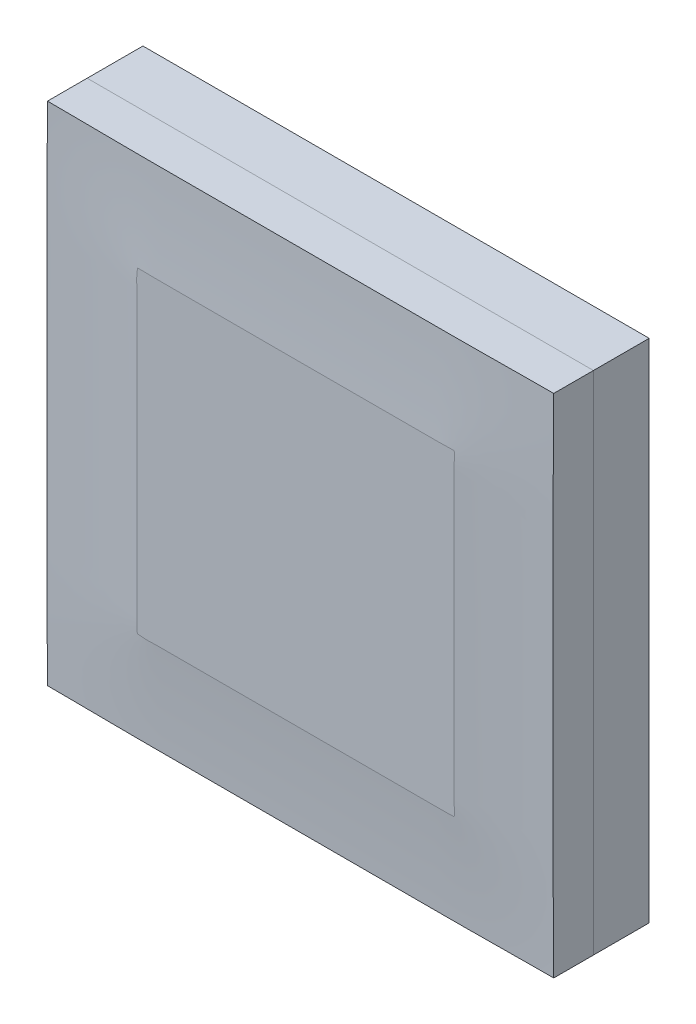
ISO-10303-21;
HEADER;
FILE_DESCRIPTION(('STEP AP214'),'2;1');
FILE_NAME('part.step','',(''),(''),'','','');
FILE_SCHEMA(('AUTOMOTIVE_DESIGN { 1 0 10303 214 1 1 1 1 }'));
ENDSEC;
DATA;
#1=APPLICATION_CONTEXT('core data for automotive mechanical design processes');
#2=APPLICATION_PROTOCOL_DEFINITION('international standard','automotive_design',2000,#1);
#3=PRODUCT_CONTEXT('',#1,'mechanical');
#4=PRODUCT('Part','Part','',(#3));
#5=PRODUCT_RELATED_PRODUCT_CATEGORY('part','',(#4));
#6=PRODUCT_DEFINITION_FORMATION('','',#4);
#7=PRODUCT_DEFINITION_CONTEXT('part definition',#1,'design');
#8=PRODUCT_DEFINITION('design','',#6,#7);
#9=PRODUCT_DEFINITION_SHAPE('','',#8);
#10=(LENGTH_UNIT() NAMED_UNIT(*) SI_UNIT(.MILLI.,.METRE.));
#11=(NAMED_UNIT(*) PLANE_ANGLE_UNIT() SI_UNIT($,.RADIAN.));
#12=(NAMED_UNIT(*) SI_UNIT($,.STERADIAN.) SOLID_ANGLE_UNIT());
#13=UNCERTAINTY_MEASURE_WITH_UNIT(LENGTH_MEASURE(1.E-05),#10,'distance_accuracy_value','');
#14=(GEOMETRIC_REPRESENTATION_CONTEXT(3) GLOBAL_UNCERTAINTY_ASSIGNED_CONTEXT((#13)) GLOBAL_UNIT_ASSIGNED_CONTEXT((#10,
#11,#12)) REPRESENTATION_CONTEXT('',''));
#15=CARTESIAN_POINT('',(0.,0.,0.));
#16=DIRECTION('',(0.,0.,1.));
#17=DIRECTION('',(1.,0.,0.));
#18=AXIS2_PLACEMENT_3D('',#15,#16,#17);
#19=CARTESIAN_POINT('',(0.,0.,0.74));
#20=DIRECTION('',(0.,0.,1.));
#21=DIRECTION('',(1.,0.,0.));
#22=AXIS2_PLACEMENT_3D('',#19,#20,#21);
#23=PLANE('',#22);
#24=CARTESIAN_POINT('',(-1.07987305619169,-1.07987305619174,0.737250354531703));
#25=CARTESIAN_POINT('',(-1.07989396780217,-1.07499365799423,0.737474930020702));
#26=CARTESIAN_POINT('',(-1.08000129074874,-1.0701159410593,0.737686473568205));
#27=CARTESIAN_POINT('',(-1.08027935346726,-1.06035333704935,0.738083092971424));
#28=CARTESIAN_POINT('',(-1.08045019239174,-1.0554684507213,0.738268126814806));
#29=CARTESIAN_POINT('',(-1.08074566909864,-1.04567831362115,0.738611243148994));
#30=CARTESIAN_POINT('',(-1.08087013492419,-1.04077305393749,0.73876922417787));
#31=CARTESIAN_POINT('',(-1.08103062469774,-1.03088997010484,0.739057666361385));
#32=CARTESIAN_POINT('',(-1.08106536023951,-1.0259121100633,0.739187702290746));
#33=CARTESIAN_POINT('',(-1.08104338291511,-1.01578503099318,0.739420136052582));
#34=CARTESIAN_POINT('',(-1.08098348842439,-1.01063579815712,0.739521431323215));
#35=CARTESIAN_POINT('',(-1.08079980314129,-1.00002553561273,0.739696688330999));
#36=CARTESIAN_POINT('',(-1.08067235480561,-0.994564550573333,0.739768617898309));
#37=CARTESIAN_POINT('',(-1.08041201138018,-0.983174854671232,0.739885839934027));
#38=CARTESIAN_POINT('',(-1.08027958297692,-0.977246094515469,0.739928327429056));
#39=CARTESIAN_POINT('',(-1.08008396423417,-0.964836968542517,0.739986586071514));
#40=CARTESIAN_POINT('',(-1.08002834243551,-0.958356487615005,0.73999951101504));
#41=CARTESIAN_POINT('',(-1.08006606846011,-0.951874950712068,0.74));
#42=B_SPLINE_CURVE_WITH_KNOTS('',3,(#24,#25,#26,#27,#28,#29,#30,#31,#32,#33,#34,#35,#36,#37,#38,
#39,#40,#41),.UNSPECIFIED.,.F.,.F.,(4,2,2,2,2,2,2,2,4),(0.,0.0146507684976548,
0.0293245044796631,0.044052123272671,0.0589900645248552,0.0744410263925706,0.090829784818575,
0.108620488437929,0.128062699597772),.UNSPECIFIED.);
#43=CARTESIAN_POINT('',(-1.079936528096,-1.079936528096,0.738625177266));
#44=VERTEX_POINT('',#43);
#45=CARTESIAN_POINT('',(-1.08,-0.951874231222,0.74));
#46=VERTEX_POINT('',#45);
#47=EDGE_CURVE('E1012',#44,#46,#42,.T.);
#48=ORIENTED_EDGE('',*,*,#47,.F.);
#49=CARTESIAN_POINT('',(-0.957583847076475,-1.08040512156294,0.739972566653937));
#50=CARTESIAN_POINT('',(-0.963972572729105,-1.08079505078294,0.73993867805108));
#51=CARTESIAN_POINT('',(-0.970360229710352,-1.08121759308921,0.73989454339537));
#52=CARTESIAN_POINT('',(-0.982599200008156,-1.08196266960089,0.739783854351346));
#53=CARTESIAN_POINT('',(-0.988450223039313,-1.08229063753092,0.739719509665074));
#54=CARTESIAN_POINT('',(-0.999713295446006,-1.08276974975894,0.739568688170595));
#55=CARTESIAN_POINT('',(-1.00512480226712,-1.08293246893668,0.739484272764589));
#56=CARTESIAN_POINT('',(-1.01561626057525,-1.08304295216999,0.739294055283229));
#57=CARTESIAN_POINT('',(-1.02069607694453,-1.08300335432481,0.739189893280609));
#58=CARTESIAN_POINT('',(-1.03059749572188,-1.08273393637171,0.73896095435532));
#59=CARTESIAN_POINT('',(-1.03541939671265,-1.08251365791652,0.738837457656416));
#60=CARTESIAN_POINT('',(-1.04484642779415,-1.08195303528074,0.738570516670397));
#61=CARTESIAN_POINT('',(-1.04945196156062,-1.08161826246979,0.738428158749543));
#62=CARTESIAN_POINT('',(-1.05846221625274,-1.08093794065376,0.738124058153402));
#63=CARTESIAN_POINT('',(-1.06286702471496,-1.08059348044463,0.737963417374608));
#64=CARTESIAN_POINT('',(-1.07146999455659,-1.08007808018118,0.737622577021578));
#65=CARTESIAN_POINT('',(-1.075667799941,-1.07989952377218,0.737443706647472));
#66=CARTESIAN_POINT('',(-1.07987305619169,-1.07987305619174,0.737250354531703));
#67=B_SPLINE_CURVE_WITH_KNOTS('',3,(#49,#50,#51,#52,#53,#54,#55,#56,#57,#58,#59,#60,#61,#62,#63,
#64,#65,#66),.UNSPECIFIED.,.F.,.F.,(4,2,2,2,2,2,2,2,4),(0.,0.0192039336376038,
0.0367850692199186,0.0530257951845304,0.0682648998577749,0.0827474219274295,0.0966070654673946,
0.109868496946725,0.122485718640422),.UNSPECIFIED.);
#68=CARTESIAN_POINT('',(-0.957583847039,-1.08040511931,0.739972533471));
#69=VERTEX_POINT('',#68);
#70=EDGE_CURVE('E1002',#69,#44,#67,.T.);
#71=ORIENTED_EDGE('',*,*,#70,.F.);
#72=CARTESIAN_POINT('',(0.0562005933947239,-1.08,0.74));
#73=CARTESIAN_POINT('',(0.0280564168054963,-1.0800112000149,0.739999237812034));
#74=CARTESIAN_POINT('',(-8.7759783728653E-05,-1.08002240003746,0.739998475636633));
#75=CARTESIAN_POINT('',(-0.0563761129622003,-1.08004480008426,0.739996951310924));
#76=CARTESIAN_POINT('',(-0.0845202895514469,-1.08005600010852,0.739996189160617));
#77=CARTESIAN_POINT('',(-0.140808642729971,-1.08007840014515,0.739994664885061));
#78=CARTESIAN_POINT('',(-0.168952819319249,-1.08008960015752,0.739993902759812));
#79=CARTESIAN_POINT('',(-0.22524117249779,-1.08011200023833,0.739992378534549));
#80=CARTESIAN_POINT('',(-0.253385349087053,-1.08012320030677,0.739991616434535));
#81=CARTESIAN_POINT('',(-0.309673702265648,-1.08014560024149,0.739990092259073));
#82=CARTESIAN_POINT('',(-0.33781787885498,-1.08015680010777,0.739989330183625));
#83=CARTESIAN_POINT('',(-0.394106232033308,-1.08017920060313,0.739987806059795));
#84=CARTESIAN_POINT('',(-0.422250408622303,-1.08019040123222,0.739987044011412));
#85=CARTESIAN_POINT('',(-0.478538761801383,-1.08021279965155,0.739985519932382));
#86=CARTESIAN_POINT('',(-0.506682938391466,-1.08022399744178,0.739984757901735));
#87=CARTESIAN_POINT('',(-0.562971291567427,-1.08024640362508,0.739983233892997));
#88=CARTESIAN_POINT('',(-0.591115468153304,-1.08025761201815,0.739982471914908));
#89=CARTESIAN_POINT('',(-0.647403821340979,-1.08027998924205,0.739980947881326));
#90=CARTESIAN_POINT('',(-0.675547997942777,-1.08029115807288,0.739980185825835));
#91=CARTESIAN_POINT('',(-0.731836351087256,-1.08031364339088,0.739978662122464));
#92=CARTESIAN_POINT('',(-0.759980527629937,-1.08032495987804,0.739977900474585));
#93=CARTESIAN_POINT('',(-0.816268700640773,-1.08034704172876,0.739976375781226));
#94=CARTESIAN_POINT('',(-0.844412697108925,-1.08035780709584,0.739975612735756));
#95=CARTESIAN_POINT('',(-0.900899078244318,-1.08038034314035,0.739974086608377));
#96=CARTESIAN_POINT('',(-0.929241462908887,-1.08039212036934,0.739973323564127));
#97=CARTESIAN_POINT('',(-0.957583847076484,-1.08040512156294,0.739972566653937));
#98=B_SPLINE_CURVE_WITH_KNOTS('',3,(#72,#73,#74,#75,#76,#77,#78,#79,#80,#81,#82,#83,#84,#85,#86,
#87,#88,#89,#90,#91,#92,#93,#94,#95,#96,#97),.UNSPECIFIED.,.F.,.F.,(4,2,2,2,2,2,2,2,2,2,2,2,4),
(0.,0.0844325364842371,0.16886507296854,0.253297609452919,0.337730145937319,0.422162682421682,
0.506595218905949,0.591027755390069,0.675460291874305,0.759892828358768,0.844325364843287,
0.928757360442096,1.01378452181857),.UNSPECIFIED.);
#99=CARTESIAN_POINT('',(0.05620059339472,-1.08,0.74));
#100=VERTEX_POINT('',#99);
#101=EDGE_CURVE('E966',#100,#69,#98,.T.);
#102=ORIENTED_EDGE('',*,*,#101,.F.);
#103=CARTESIAN_POINT('',(0.581559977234,-1.08,0.74));
#104=CARTESIAN_POINT('',(0.563921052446,-1.08,0.74));
#105=CARTESIAN_POINT('',(0.546282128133,-1.08,0.74));
#106=CARTESIAN_POINT('',(0.371162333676,-1.08,0.74));
#107=CARTESIAN_POINT('',(0.213681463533,-1.08,0.74));
#108=CARTESIAN_POINT('',(0.05620059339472,-1.08,0.74));
#109=(BOUNDED_CURVE() B_SPLINE_CURVE(3,(#103,#104,#105,#106,#107,#108),.UNSPECIFIED.,.F.,
.F.) B_SPLINE_CURVE_WITH_KNOTS((4,2,4),(0.181243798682,0.1875,0.24335556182),
.UNSPECIFIED.) CURVE() GEOMETRIC_REPRESENTATION_ITEM() RATIONAL_B_SPLINE_CURVE((1.,1.,1.,1.,1.,1.)) REPRESENTATION_ITEM(''));
#110=CARTESIAN_POINT('',(0.581559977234,-1.08,0.74));
#111=VERTEX_POINT('',#110);
#112=EDGE_CURVE('E960',#111,#100,#109,.T.);
#113=ORIENTED_EDGE('',*,*,#112,.F.);
#114=CARTESIAN_POINT('',(0.957630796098,-1.08,0.74));
#115=CARTESIAN_POINT('',(0.94797745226,-1.080095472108,0.740004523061));
#116=CARTESIAN_POINT('',(0.941230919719,-1.08007062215,0.74));
#117=CARTESIAN_POINT('',(0.925448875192,-1.079985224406,0.74));
#118=CARTESIAN_POINT('',(0.91769574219,-1.079998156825,0.74));
#119=CARTESIAN_POINT('',(0.894315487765,-1.079996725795,0.74));
#120=CARTESIAN_POINT('',(0.878734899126,-1.079999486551,0.74));
#121=CARTESIAN_POINT('',(0.831981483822,-1.08000084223,0.74));
#122=CARTESIAN_POINT('',(0.800682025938,-1.08,0.74));
#123=CARTESIAN_POINT('',(0.70677257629,-1.08,0.74));
#124=CARTESIAN_POINT('',(0.644166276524,-1.08,0.74));
#125=CARTESIAN_POINT('',(0.581559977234,-1.08,0.74));
#126=(BOUNDED_CURVE() B_SPLINE_CURVE(3,(#114,#115,#116,#117,#118,#119,#120,#121,#122,#123,#124,
#125),.UNSPECIFIED.,.F.,.F.) B_SPLINE_CURVE_WITH_KNOTS((4,2,2,2,2,4),(0.246373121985,
0.293474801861,0.340576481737,0.434779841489,0.623186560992,1.),
.UNSPECIFIED.) CURVE() GEOMETRIC_REPRESENTATION_ITEM() RATIONAL_B_SPLINE_CURVE((1.,1.,1.,1.,1.,
1.,1.,1.,1.,1.,1.,1.)) REPRESENTATION_ITEM(''));
#127=CARTESIAN_POINT('',(0.957630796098,-1.08,0.74));
#128=VERTEX_POINT('',#127);
#129=EDGE_CURVE('E955',#128,#111,#126,.T.);
#130=ORIENTED_EDGE('',*,*,#129,.F.);
#131=CARTESIAN_POINT('',(1.07987305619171,-1.07987305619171,0.737250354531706));
#132=CARTESIAN_POINT('',(1.07502559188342,-1.07989144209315,0.737473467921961));
#133=CARTESIAN_POINT('',(1.07017865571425,-1.0799684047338,0.737685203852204));
#134=CARTESIAN_POINT('',(1.06053691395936,-1.08015660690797,0.738081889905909));
#135=CARTESIAN_POINT('',(1.05574211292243,-1.08026746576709,0.738267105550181));
#136=CARTESIAN_POINT('',(1.04618871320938,-1.08044380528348,0.738610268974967));
#137=CARTESIAN_POINT('',(1.04143012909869,-1.08050963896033,0.738768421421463));
#138=CARTESIAN_POINT('',(1.03189665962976,-1.08057271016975,0.739056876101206));
#139=CARTESIAN_POINT('',(1.02712176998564,-1.08056973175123,0.739187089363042));
#140=CARTESIAN_POINT('',(1.0174599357,-1.08050390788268,0.739419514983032));
#141=CARTESIAN_POINT('',(1.01257298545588,-1.08043966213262,0.739521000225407));
#142=CARTESIAN_POINT('',(1.00255303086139,-1.08028186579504,0.739696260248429));
#143=CARTESIAN_POINT('',(0.997420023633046,-1.08018700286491,0.739768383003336));
#144=CARTESIAN_POINT('',(0.986758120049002,-1.0800187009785,0.739885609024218));
#145=CARTESIAN_POINT('',(0.981229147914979,-1.07994747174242,0.739928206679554));
#146=CARTESIAN_POINT('',(0.969677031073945,-1.07988515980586,0.739986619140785));
#147=CARTESIAN_POINT('',(0.96365384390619,-1.07990180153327,0.739999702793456));
#148=CARTESIAN_POINT('',(0.957630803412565,-1.080000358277,0.74));
#149=B_SPLINE_CURVE_WITH_KNOTS('',3,(#131,#132,#133,#134,#135,#136,#137,#138,#139,#140,#141,
#142,#143,#144,#145,#146,#147,#148),.UNSPECIFIED.,.F.,.F.,(4,2,2,2,2,2,2,2,4),(0.,
0.0145566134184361,0.0289554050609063,0.0432399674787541,0.0575693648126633,0.0722343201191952,
0.0876374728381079,0.104225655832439,0.122295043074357),.UNSPECIFIED.);
#150=CARTESIAN_POINT('',(1.079936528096,-1.079936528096,0.738625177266));
#151=VERTEX_POINT('',#150);
#152=EDGE_CURVE('E948',#151,#128,#149,.T.);
#153=ORIENTED_EDGE('',*,*,#152,.F.);
#154=CARTESIAN_POINT('',(1.08051941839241,-0.957562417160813,0.739964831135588));
#155=CARTESIAN_POINT('',(1.08044382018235,-0.963640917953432,0.73996296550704));
#156=CARTESIAN_POINT('',(1.08044430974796,-0.969719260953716,0.739948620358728));
#157=CARTESIAN_POINT('',(1.08052192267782,-0.981374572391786,0.739888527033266));
#158=CARTESIAN_POINT('',(1.08059272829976,-0.986951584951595,0.739845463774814));
#159=CARTESIAN_POINT('',(1.08074033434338,-0.997700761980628,0.739728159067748));
#160=CARTESIAN_POINT('',(1.08081632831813,-1.00287297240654,0.739656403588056));
#161=CARTESIAN_POINT('',(1.08091916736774,-1.01295728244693,0.739482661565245));
#162=CARTESIAN_POINT('',(1.08094829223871,-1.01786938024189,0.739382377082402));
#163=CARTESIAN_POINT('',(1.08093388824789,-1.0275611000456,0.739153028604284));
#164=CARTESIAN_POINT('',(1.08089228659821,-1.03234074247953,0.739024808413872));
#165=CARTESIAN_POINT('',(1.0807389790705,-1.0418582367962,0.738740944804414));
#166=CARTESIAN_POINT('',(1.0806278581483,-1.04659610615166,0.738585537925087));
#167=CARTESIAN_POINT('',(1.08037000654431,-1.05607941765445,0.738248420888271));
#168=CARTESIAN_POINT('',(1.08022320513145,-1.06082485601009,0.738066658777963));
#169=CARTESIAN_POINT('',(1.07998395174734,-1.07033749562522,0.737677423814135));
#170=CARTESIAN_POINT('',(1.07989174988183,-1.07510469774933,0.737469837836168));
#171=CARTESIAN_POINT('',(1.07987305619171,-1.07987305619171,0.737250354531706));
#172=B_SPLINE_CURVE_WITH_KNOTS('',3,(#154,#155,#156,#157,#158,#159,#160,#161,#162,#163,#164,
#165,#166,#167,#168,#169,#170,#171),.UNSPECIFIED.,.F.,.F.,(4,2,2,2,2,2,2,2,4),(0.,
0.018235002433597,0.0349674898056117,0.0504872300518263,0.0652263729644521,0.0795702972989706,
0.0937951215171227,0.108048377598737,0.122366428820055),.UNSPECIFIED.);
#173=CARTESIAN_POINT('',(1.080519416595,-0.957562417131,0.739964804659));
#174=VERTEX_POINT('',#173);
#175=EDGE_CURVE('E929',#151,#174,#172,.F.);
#176=ORIENTED_EDGE('',*,*,#175,.T.);
#177=CARTESIAN_POINT('',(1.08,-0.111616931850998,0.74));
#178=CARTESIAN_POINT('',(1.08001723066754,-0.139795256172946,0.739998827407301));
#179=CARTESIAN_POINT('',(1.08003446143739,-0.167973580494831,0.739997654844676));
#180=CARTESIAN_POINT('',(1.08006892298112,-0.224330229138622,0.739995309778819));
#181=CARTESIAN_POINT('',(1.08008615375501,-0.252508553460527,0.739994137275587));
#182=CARTESIAN_POINT('',(1.08012061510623,-0.308865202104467,0.739991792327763));
#183=CARTESIAN_POINT('',(1.08013784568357,-0.337043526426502,0.73999061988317));
#184=CARTESIAN_POINT('',(1.08017230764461,-0.393400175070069,0.739988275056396));
#185=CARTESIAN_POINT('',(1.08018953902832,-0.421578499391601,0.739987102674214));
#186=CARTESIAN_POINT('',(1.08022399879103,-0.477935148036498,0.739984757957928));
#187=CARTESIAN_POINT('',(1.08024122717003,-0.506113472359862,0.739983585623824));
#188=CARTESIAN_POINT('',(1.08027569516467,-0.562470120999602,0.739981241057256));
#189=CARTESIAN_POINT('',(1.0802929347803,-0.590648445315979,0.739980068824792));
#190=CARTESIAN_POINT('',(1.08032737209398,-0.647005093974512,0.739977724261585));
#191=CARTESIAN_POINT('',(1.08034456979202,-0.675183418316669,0.739976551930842));
#192=CARTESIAN_POINT('',(1.08037912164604,-0.731540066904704,0.739974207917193));
#193=CARTESIAN_POINT('',(1.08039647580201,-0.759718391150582,0.739973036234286));
#194=CARTESIAN_POINT('',(1.08043060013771,-0.81607489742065,0.739970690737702));
#195=CARTESIAN_POINT('',(1.0804473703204,-0.844253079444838,0.739969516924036));
#196=CARTESIAN_POINT('',(1.08048209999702,-0.90080831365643,0.739967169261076));
#197=CARTESIAN_POINT('',(1.08050006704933,-0.92918536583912,0.739965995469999));
#198=CARTESIAN_POINT('',(1.08051941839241,-0.957562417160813,0.739964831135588));
#199=B_SPLINE_CURVE_WITH_KNOTS('',3,(#177,#178,#179,#180,#181,#182,#183,#184,#185,#186,#187,
#188,#189,#190,#191,#192,#193,#194,#195,#196,#197,#198),.UNSPECIFIED.,.F.,.F.,(4,2,2,2,2,2,2,2,
2,2,4),(0.,0.0845349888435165,0.169069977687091,0.253604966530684,0.338139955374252,
0.422674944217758,0.50720993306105,0.59174492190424,0.676279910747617,0.7608144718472,
0.845945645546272),.UNSPECIFIED.);
#200=CARTESIAN_POINT('',(1.08,-0.111616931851,0.74));
#201=VERTEX_POINT('',#200);
#202=EDGE_CURVE('E925',#174,#201,#199,.F.);
#203=ORIENTED_EDGE('',*,*,#202,.T.);
#204=CARTESIAN_POINT('',(1.08,-0.111616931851,0.74));
#205=CARTESIAN_POINT('',(1.08,-0.07441130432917,0.74));
#206=CARTESIAN_POINT('',(1.08,-0.03720567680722,0.74));
#207=CARTESIAN_POINT('',(1.08,-4.928527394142E-08,0.74));
#208=(BOUNDED_CURVE() B_SPLINE_CURVE(3,(#204,#205,#206,#207),.UNSPECIFIED.,.F.,
.F.) B_SPLINE_CURVE_WITH_KNOTS((4,4),(0.,1.),
.UNSPECIFIED.) CURVE() GEOMETRIC_REPRESENTATION_ITEM() RATIONAL_B_SPLINE_CURVE((1.,1.,1.,1.)) REPRESENTATION_ITEM(''));
#209=CARTESIAN_POINT('',(1.08,-4.928527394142E-08,0.74));
#210=VERTEX_POINT('',#209);
#211=EDGE_CURVE('E920',#201,#210,#208,.T.);
#212=ORIENTED_EDGE('',*,*,#211,.T.);
#213=CARTESIAN_POINT('',(1.08071751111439,0.957521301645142,0.739951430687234));
#214=CARTESIAN_POINT('',(1.08070486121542,0.953593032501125,0.739955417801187));
#215=CARTESIAN_POINT('',(1.08068480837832,0.949664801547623,0.739958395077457));
#216=CARTESIAN_POINT('',(1.08059872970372,0.935576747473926,0.739966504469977));
#217=CARTESIAN_POINT('',(1.08051023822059,0.925417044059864,0.739967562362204));
#218=CARTESIAN_POINT('',(1.0803666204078,0.898956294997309,0.739971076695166));
#219=CARTESIAN_POINT('',(1.08036399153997,0.882655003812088,0.739973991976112));
#220=CARTESIAN_POINT('',(1.08032982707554,0.84381386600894,0.739979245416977));
#221=CARTESIAN_POINT('',(1.08028761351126,0.821274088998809,0.739980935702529));
#222=CARTESIAN_POINT('',(1.08021796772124,0.769956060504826,0.739984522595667));
#223=CARTESIAN_POINT('',(1.08019786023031,0.741177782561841,0.739986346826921));
#224=CARTESIAN_POINT('',(1.08015491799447,0.677382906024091,0.739989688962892));
#225=CARTESIAN_POINT('',(1.08013243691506,0.642366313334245,0.739991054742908));
#226=CARTESIAN_POINT('',(1.08009278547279,0.566094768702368,0.739993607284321));
#227=CARTESIAN_POINT('',(1.08007727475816,0.524839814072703,0.739994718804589));
#228=CARTESIAN_POINT('',(1.08004926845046,0.436091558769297,0.739996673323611));
#229=CARTESIAN_POINT('',(1.08003758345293,0.388598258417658,0.739997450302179));
#230=CARTESIAN_POINT('',(1.08001834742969,0.287373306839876,0.739998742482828));
#231=CARTESIAN_POINT('',(1.08001154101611,0.233641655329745,0.739999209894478));
#232=CARTESIAN_POINT('',(1.08000222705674,0.119940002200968,0.739999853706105));
#233=CARTESIAN_POINT('',(1.08000031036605,0.0599700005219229,0.73999999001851));
#234=CARTESIAN_POINT('',(1.08,0.,0.74));
#235=B_SPLINE_CURVE_WITH_KNOTS('',3,(#213,#214,#215,#216,#217,#218,#219,#220,#221,#222,#223,
#224,#225,#226,#227,#228,#229,#230,#231,#232,#233,#234),.UNSPECIFIED.,.F.,.F.,(4,2,2,2,2,2,2,2,
2,2,4),(0.,0.0117848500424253,0.042264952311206,0.0911684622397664,0.158788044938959,
0.245122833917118,0.350172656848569,0.473937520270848,0.616417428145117,0.777612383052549,
0.957522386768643),.UNSPECIFIED.);
#236=CARTESIAN_POINT('',(1.080717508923,0.957521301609,0.739951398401));
#237=VERTEX_POINT('',#236);
#238=EDGE_CURVE('E914',#210,#237,#235,.F.);
#239=ORIENTED_EDGE('',*,*,#238,.T.);
#240=CARTESIAN_POINT('',(1.07987305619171,1.07987305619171,0.737250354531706));
#241=CARTESIAN_POINT('',(1.07989165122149,1.07508799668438,0.737470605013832));
#242=CARTESIAN_POINT('',(1.0799820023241,1.07030401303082,0.737679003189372));
#243=CARTESIAN_POINT('',(1.08021627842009,1.06076536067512,0.738069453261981));
#244=CARTESIAN_POINT('',(1.08035987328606,1.05601069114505,0.738251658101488));
#245=CARTESIAN_POINT('',(1.08061267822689,1.0465151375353,0.738589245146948));
#246=CARTESIAN_POINT('',(1.08072199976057,1.0417742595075,0.738744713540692));
#247=CARTESIAN_POINT('',(1.08087537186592,1.03225506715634,0.739028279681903));
#248=CARTESIAN_POINT('',(1.08091892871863,1.0274767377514,0.739156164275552));
#249=CARTESIAN_POINT('',(1.08094269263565,1.01778973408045,0.739384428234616));
#250=CARTESIAN_POINT('',(1.0809211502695,1.01288103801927,0.739483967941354));
#251=CARTESIAN_POINT('',(1.08083977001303,1.00280376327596,0.739655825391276));
#252=CARTESIAN_POINT('',(1.08077796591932,0.997635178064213,0.739726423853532));
#253=CARTESIAN_POINT('',(1.08066505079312,0.98689285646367,0.739841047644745));
#254=CARTESIAN_POINT('',(1.08061515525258,0.981319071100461,0.739882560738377));
#255=CARTESIAN_POINT('',(1.08058566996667,0.969670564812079,0.739939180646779));
#256=CARTESIAN_POINT('',(1.08061279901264,0.963595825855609,0.739951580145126));
#257=CARTESIAN_POINT('',(1.08071751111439,0.957521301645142,0.739951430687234));
#258=B_SPLINE_CURVE_WITH_KNOTS('',3,(#240,#241,#242,#243,#244,#245,#246,#247,#248,#249,#250,
#251,#252,#253,#254,#255,#256,#257),.UNSPECIFIED.,.F.,.F.,(4,2,2,2,2,2,2,2,4),(0.,
0.0143683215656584,0.0286490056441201,0.0428827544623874,0.0572228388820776,0.071951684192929,
0.0874599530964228,0.104181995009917,0.122406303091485),.UNSPECIFIED.);
#259=CARTESIAN_POINT('',(1.079936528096,1.079936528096,0.738625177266));
#260=VERTEX_POINT('',#259);
#261=EDGE_CURVE('E775',#237,#260,#258,.F.);
#262=ORIENTED_EDGE('',*,*,#261,.T.);
#263=CARTESIAN_POINT('',(0.957562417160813,1.08051941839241,0.739964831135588));
#264=CARTESIAN_POINT('',(0.963640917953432,1.08044382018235,0.73996296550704));
#265=CARTESIAN_POINT('',(0.969719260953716,1.08044430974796,0.739948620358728));
#266=CARTESIAN_POINT('',(0.981374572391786,1.08052192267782,0.739888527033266));
#267=CARTESIAN_POINT('',(0.986951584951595,1.08059272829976,0.739845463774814));
#268=CARTESIAN_POINT('',(0.997700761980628,1.08074033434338,0.739728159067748));
#269=CARTESIAN_POINT('',(1.00287297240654,1.08081632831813,0.739656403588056));
#270=CARTESIAN_POINT('',(1.01295728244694,1.08091916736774,0.739482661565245));
#271=CARTESIAN_POINT('',(1.01786938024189,1.08094829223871,0.739382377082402));
#272=CARTESIAN_POINT('',(1.0275611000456,1.08093388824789,0.739153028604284));
#273=CARTESIAN_POINT('',(1.03234074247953,1.08089228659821,0.739024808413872));
#274=CARTESIAN_POINT('',(1.0418582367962,1.0807389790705,0.738740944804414));
#275=CARTESIAN_POINT('',(1.04659610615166,1.0806278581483,0.738585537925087));
#276=CARTESIAN_POINT('',(1.05607941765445,1.08037000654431,0.738248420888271));
#277=CARTESIAN_POINT('',(1.0608248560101,1.08022320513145,0.738066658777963));
#278=CARTESIAN_POINT('',(1.07033749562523,1.07998395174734,0.737677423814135));
#279=CARTESIAN_POINT('',(1.07510469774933,1.07989174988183,0.737469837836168));
#280=CARTESIAN_POINT('',(1.07987305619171,1.07987305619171,0.737250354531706));
#281=B_SPLINE_CURVE_WITH_KNOTS('',3,(#263,#264,#265,#266,#267,#268,#269,#270,#271,#272,#273,
#274,#275,#276,#277,#278,#279,#280),.UNSPECIFIED.,.F.,.F.,(4,2,2,2,2,2,2,2,4),(0.,
0.0182350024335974,0.0349674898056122,0.0504872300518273,0.0652263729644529,0.0795702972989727,
0.0937951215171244,0.108048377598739,0.122366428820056),.UNSPECIFIED.);
#282=CARTESIAN_POINT('',(0.957562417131,1.080519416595,0.739964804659));
#283=VERTEX_POINT('',#282);
#284=EDGE_CURVE('E674',#260,#283,#281,.F.);
#285=ORIENTED_EDGE('',*,*,#284,.T.);
#286=CARTESIAN_POINT('',(0.00128707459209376,1.08,0.74));
#287=CARTESIAN_POINT('',(0.0331430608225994,1.08001723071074,0.739998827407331));
#288=CARTESIAN_POINT('',(0.0649990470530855,1.08003446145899,0.739997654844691));
#289=CARTESIAN_POINT('',(0.128711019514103,1.08006892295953,0.739995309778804));
#290=CARTESIAN_POINT('',(0.160567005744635,1.08008615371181,0.739994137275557));
#291=CARTESIAN_POINT('',(0.224278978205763,1.08012061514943,0.739991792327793));
#292=CARTESIAN_POINT('',(0.256134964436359,1.08013784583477,0.739990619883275));
#293=CARTESIAN_POINT('',(0.319846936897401,1.08017230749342,0.739988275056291));
#294=CARTESIAN_POINT('',(0.351702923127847,1.08018953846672,0.739987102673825));
#295=CARTESIAN_POINT('',(0.415414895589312,1.08022399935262,0.739984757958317));
#296=CARTESIAN_POINT('',(0.447270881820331,1.0802412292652,0.739983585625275));
#297=CARTESIAN_POINT('',(0.510982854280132,1.08027569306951,0.739981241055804));
#298=CARTESIAN_POINT('',(0.542838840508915,1.08029292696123,0.739980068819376));
#299=CARTESIAN_POINT('',(0.606550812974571,1.08032737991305,0.739977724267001));
#300=CARTESIAN_POINT('',(0.638406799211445,1.08034459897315,0.739976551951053));
#301=CARTESIAN_POINT('',(0.702118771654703,1.08037909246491,0.739974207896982));
#302=CARTESIAN_POINT('',(0.733974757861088,1.08039636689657,0.739973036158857));
#303=CARTESIAN_POINT('',(0.797686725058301,1.08043070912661,0.739970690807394));
#304=CARTESIAN_POINT('',(0.82954270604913,1.08044777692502,0.739969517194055));
#305=CARTESIAN_POINT('',(0.893453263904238,1.08048275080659,0.739967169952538));
#306=CARTESIAN_POINT('',(0.925507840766,1.08050066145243,0.73996599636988));
#307=CARTESIAN_POINT('',(0.957562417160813,1.08051941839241,0.739964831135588));
#308=B_SPLINE_CURVE_WITH_KNOTS('',3,(#286,#287,#288,#289,#290,#291,#292,#293,#294,#295,#296,
#297,#298,#299,#300,#301,#302,#303,#304,#305,#306,#307),.UNSPECIFIED.,.F.,.F.,(4,2,2,2,2,2,2,2,
2,2,4),(0.,0.0955679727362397,0.191135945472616,0.286703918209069,0.38227189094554,
0.47783986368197,0.573407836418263,0.668975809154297,0.764543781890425,0.860111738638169,
0.956275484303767),.UNSPECIFIED.);
#309=CARTESIAN_POINT('',(0.001287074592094,1.08,0.74));
#310=VERTEX_POINT('',#309);
#311=EDGE_CURVE('E1069',#283,#310,#308,.F.);
#312=ORIENTED_EDGE('',*,*,#311,.T.);
#313=CARTESIAN_POINT('',(0.001287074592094,1.08,0.74));
#314=CARTESIAN_POINT('',(-0.01787548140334,1.08,0.74));
#315=CARTESIAN_POINT('',(-0.03703803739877,1.08,0.74));
#316=CARTESIAN_POINT('',(-0.05620059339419,1.08,0.74));
#317=(BOUNDED_CURVE() B_SPLINE_CURVE(3,(#313,#314,#315,#316),.UNSPECIFIED.,.F.,
.F.) B_SPLINE_CURVE_WITH_KNOTS((4,4),(0.,1.),
.UNSPECIFIED.) CURVE() GEOMETRIC_REPRESENTATION_ITEM() RATIONAL_B_SPLINE_CURVE((1.,1.,1.,1.)) REPRESENTATION_ITEM(''));
#318=CARTESIAN_POINT('',(-0.05620059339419,1.08,0.74));
#319=VERTEX_POINT('',#318);
#320=EDGE_CURVE('E1064',#310,#319,#317,.T.);
#321=ORIENTED_EDGE('',*,*,#320,.T.);
#322=CARTESIAN_POINT('',(-0.957521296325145,1.08071751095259,0.739951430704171));
#323=CARTESIAN_POINT('',(-0.92729768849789,1.0806913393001,0.739953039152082));
#324=CARTESIAN_POINT('',(-0.897074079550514,1.08066655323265,0.73995465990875));
#325=CARTESIAN_POINT('',(-0.836826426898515,1.08061830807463,0.739957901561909));
#326=CARTESIAN_POINT('',(-0.806802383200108,1.0805948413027,0.739959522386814));
#327=CARTESIAN_POINT('',(-0.746754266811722,1.08054748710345,0.739962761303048));
#328=CARTESIAN_POINT('',(-0.716730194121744,1.08052359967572,0.739964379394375));
#329=CARTESIAN_POINT('',(-0.656682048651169,1.08047593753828,0.739967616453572));
#330=CARTESIAN_POINT('',(-0.626657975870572,1.08045216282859,0.739969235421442));
#331=CARTESIAN_POINT('',(-0.566609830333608,1.0804045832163,0.739972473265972));
#332=CARTESIAN_POINT('',(-0.536585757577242,1.08038077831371,0.739974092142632));
#333=CARTESIAN_POINT('',(-0.476537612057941,1.08033317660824,0.739977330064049));
#334=CARTESIAN_POINT('',(-0.446513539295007,1.08030937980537,0.739978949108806));
#335=CARTESIAN_POINT('',(-0.386465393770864,1.08026178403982,0.739982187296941));
#336=CARTESIAN_POINT('',(-0.356441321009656,1.08023798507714,0.73998380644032));
#337=CARTESIAN_POINT('',(-0.296393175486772,1.08019038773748,0.739987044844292));
#338=CARTESIAN_POINT('',(-0.266369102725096,1.08016658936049,0.739988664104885));
#339=CARTESIAN_POINT('',(-0.206320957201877,1.08011899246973,0.739991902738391));
#340=CARTESIAN_POINT('',(-0.176296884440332,1.08009519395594,0.739993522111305));
#341=CARTESIAN_POINT('',(-0.116248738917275,1.08004759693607,0.739996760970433));
#342=CARTESIAN_POINT('',(-0.0862246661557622,1.08002379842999,0.739998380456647));
#343=CARTESIAN_POINT('',(-0.056200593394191,1.08,0.74));
#344=B_SPLINE_CURVE_WITH_KNOTS('',3,(#322,#323,#324,#325,#326,#327,#328,#329,#330,#331,#332,
#333,#334,#335,#336,#337,#338,#339,#340,#341,#342,#343),.UNSPECIFIED.,.F.,.F.,(4,2,2,2,2,2,2,2,
2,2,4),(0.,0.0906708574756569,0.180743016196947,0.270815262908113,0.360887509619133,
0.450959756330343,0.541032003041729,0.631104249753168,0.721176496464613,0.811248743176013,
0.901320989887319),.UNSPECIFIED.);
#345=CARTESIAN_POINT('',(-0.957521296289,1.080717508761,0.739951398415));
#346=VERTEX_POINT('',#345);
#347=EDGE_CURVE('E1060',#319,#346,#344,.F.);
#348=ORIENTED_EDGE('',*,*,#347,.T.);
#349=CARTESIAN_POINT('',(-1.07987305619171,1.07987305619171,0.737250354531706));
#350=CARTESIAN_POINT('',(-1.07508799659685,1.07989165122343,0.737470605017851));
#351=CARTESIAN_POINT('',(-1.07030401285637,1.07998200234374,0.737679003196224));
#352=CARTESIAN_POINT('',(-1.06076536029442,1.08021627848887,0.738069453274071));
#353=CARTESIAN_POINT('',(-1.05601069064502,1.08035987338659,0.73825165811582));
#354=CARTESIAN_POINT('',(-1.04651513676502,1.08061267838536,0.738589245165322));
#355=CARTESIAN_POINT('',(-1.04177425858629,1.08072199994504,0.738744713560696));
#356=CARTESIAN_POINT('',(-1.03225506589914,1.08087537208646,0.739028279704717));
#357=CARTESIAN_POINT('',(-1.02747673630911,1.08091892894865,0.73915616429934));
#358=CARTESIAN_POINT('',(-1.01778973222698,1.08094269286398,0.739384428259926));
#359=CARTESIAN_POINT('',(-1.01288103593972,1.08092115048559,0.739483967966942));
#360=CARTESIAN_POINT('',(-1.0028037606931,1.08083977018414,0.739655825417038));
#361=CARTESIAN_POINT('',(-0.997635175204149,1.08077796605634,0.739726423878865));
#362=CARTESIAN_POINT('',(-0.986892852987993,1.08066505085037,0.739841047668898));
#363=CARTESIAN_POINT('',(-0.981319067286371,1.08061515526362,0.739882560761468));
#364=CARTESIAN_POINT('',(-0.969670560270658,1.08058566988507,0.739939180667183));
#365=CARTESIAN_POINT('',(-0.963595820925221,1.08061279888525,0.739951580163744));
#366=CARTESIAN_POINT('',(-0.957521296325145,1.08071751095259,0.739951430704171));
#367=B_SPLINE_CURVE_WITH_KNOTS('',3,(#349,#350,#351,#352,#353,#354,#355,#356,#357,#358,#359,
#360,#361,#362,#363,#364,#365,#366),.UNSPECIFIED.,.F.,.F.,(4,2,2,2,2,2,2,2,4),(0.,
0.0143683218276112,0.0286490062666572,0.0428827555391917,0.0572228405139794,0.0719516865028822,
0.0874599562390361,0.104181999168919,0.122406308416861),.UNSPECIFIED.);
#368=CARTESIAN_POINT('',(-1.079936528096,1.079936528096,0.738625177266));
#369=VERTEX_POINT('',#368);
#370=EDGE_CURVE('E1055',#346,#369,#367,.F.);
#371=ORIENTED_EDGE('',*,*,#370,.T.);
#372=CARTESIAN_POINT('',(-1.08023144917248,0.957601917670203,0.739984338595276));
#373=CARTESIAN_POINT('',(-1.08071547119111,0.964041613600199,0.739943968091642));
#374=CARTESIAN_POINT('',(-1.08122458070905,0.970480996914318,0.739893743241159));
#375=CARTESIAN_POINT('',(-1.08210957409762,0.982818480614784,0.739772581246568));
#376=CARTESIAN_POINT('',(-1.08249310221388,0.98871608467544,0.739703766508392));
#377=CARTESIAN_POINT('',(-1.0830488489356,1.0000679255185,0.739545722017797));
#378=CARTESIAN_POINT('',(-1.08323504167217,1.00552140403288,0.73945846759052));
#379=CARTESIAN_POINT('',(-1.08336128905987,1.01608494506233,0.73926425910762));
#380=CARTESIAN_POINT('',(-1.08331622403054,1.02119482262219,0.739158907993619));
#381=CARTESIAN_POINT('',(-1.08301332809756,1.0311340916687,0.738929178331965));
#382=CARTESIAN_POINT('',(-1.08276699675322,1.03596387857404,0.738806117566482));
#383=CARTESIAN_POINT('',(-1.08214420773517,1.04537529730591,0.738541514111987));
#384=CARTESIAN_POINT('',(-1.08177472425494,1.04995748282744,0.738401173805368));
#385=CARTESIAN_POINT('',(-1.08102778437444,1.05888392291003,0.738102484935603));
#386=CARTESIAN_POINT('',(-1.08065171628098,1.063228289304,0.737945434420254));
#387=CARTESIAN_POINT('',(-1.08009392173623,1.0716701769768,0.737612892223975));
#388=CARTESIAN_POINT('',(-1.07990205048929,1.07576716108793,0.737439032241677));
#389=CARTESIAN_POINT('',(-1.07987305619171,1.07987305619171,0.737250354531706));
#390=B_SPLINE_CURVE_WITH_KNOTS('',3,(#372,#373,#374,#375,#376,#377,#378,#379,#380,#381,#382,
#383,#384,#385,#386,#387,#388,#389),.UNSPECIFIED.,.F.,.F.,(4,2,2,2,2,2,2,2,4),(0.,
0.0193768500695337,0.0371073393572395,0.053475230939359,0.0688036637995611,0.0833128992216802,
0.0971105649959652,0.1101983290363,0.122514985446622),.UNSPECIFIED.);
#391=CARTESIAN_POINT('',(-1.080231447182,0.957601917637,0.739984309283));
#392=VERTEX_POINT('',#391);
#393=EDGE_CURVE('E1028',#392,#369,#390,.T.);
#394=ORIENTED_EDGE('',*,*,#393,.F.);
#395=CARTESIAN_POINT('',(-1.08,-0.0562005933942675,0.74));
#396=CARTESIAN_POINT('',(-1.08000639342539,-0.0280558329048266,0.739999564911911));
#397=CARTESIAN_POINT('',(-1.08001278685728,8.89275846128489E-05,0.73999912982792));
#398=CARTESIAN_POINT('',(-1.08002557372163,0.0563784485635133,0.739998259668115));
#399=CARTESIAN_POINT('',(-1.08003196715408,0.0845232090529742,0.739997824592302));
#400=CARTESIAN_POINT('',(-1.08004475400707,0.140812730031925,0.739996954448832));
#401=CARTESIAN_POINT('',(-1.08005114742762,0.168957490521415,0.739996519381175));
#402=CARTESIAN_POINT('',(-1.08006393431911,0.22524701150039,0.739995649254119));
#403=CARTESIAN_POINT('',(-1.08007032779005,0.253391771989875,0.73999521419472));
#404=CARTESIAN_POINT('',(-1.08008311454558,0.309681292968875,0.739994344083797));
#405=CARTESIAN_POINT('',(-1.08008950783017,0.33782605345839,0.739993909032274));
#406=CARTESIAN_POINT('',(-1.08010229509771,0.39411557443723,0.739993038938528));
#407=CARTESIAN_POINT('',(-1.08010868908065,0.422260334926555,0.739992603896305));
#408=CARTESIAN_POINT('',(-1.0801214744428,0.478549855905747,0.739991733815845));
#409=CARTESIAN_POINT('',(-1.080127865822,0.506694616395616,0.739991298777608));
#410=CARTESIAN_POINT('',(-1.08014065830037,0.562984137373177,0.739990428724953));
#411=CARTESIAN_POINT('',(-1.08014705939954,0.591128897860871,0.739989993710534));
#412=CARTESIAN_POINT('',(-1.08015982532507,0.647418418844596,0.7399891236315));
#413=CARTESIAN_POINT('',(-1.08016619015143,0.675563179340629,0.739988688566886));
#414=CARTESIAN_POINT('',(-1.08017905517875,0.731852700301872,0.739987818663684));
#415=CARTESIAN_POINT('',(-1.08018555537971,0.759997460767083,0.739987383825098));
#416=CARTESIAN_POINT('',(-1.0801980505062,0.816286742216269,0.739986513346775));
#417=CARTESIAN_POINT('',(-1.08020404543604,0.844431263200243,0.739986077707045));
#418=CARTESIAN_POINT('',(-1.0802168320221,0.900917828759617,0.739985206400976));
#419=CARTESIAN_POINT('',(-1.08022362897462,0.92925987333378,0.739984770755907));
#420=CARTESIAN_POINT('',(-1.08023144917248,0.957601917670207,0.739984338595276));
#421=B_SPLINE_CURVE_WITH_KNOTS('',3,(#395,#396,#397,#398,#399,#400,#401,#402,#403,#404,#405,
#406,#407,#408,#409,#410,#411,#412,#413,#414,#415,#416,#417,#418,#419,#420),.UNSPECIFIED.,.F.,
.F.,(4,2,2,2,2,2,2,2,2,2,2,2,4),(0.,0.0844342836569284,0.168868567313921,0.253302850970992,
0.337737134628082,0.422171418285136,0.506605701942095,0.591039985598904,0.675474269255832,
0.759908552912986,0.844342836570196,0.928776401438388,1.01380253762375),.UNSPECIFIED.);
#422=CARTESIAN_POINT('',(-1.08,-0.05620059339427,0.74));
#423=VERTEX_POINT('',#422);
#424=EDGE_CURVE('E1022',#423,#392,#421,.T.);
#425=ORIENTED_EDGE('',*,*,#424,.F.);
#426=CARTESIAN_POINT('',(-1.08,-0.951874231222,0.74));
#427=CARTESIAN_POINT('',(-1.08007888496,-0.939101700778,0.74));
#428=CARTESIAN_POINT('',(-1.080001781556,-0.932051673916,0.74));
#429=CARTESIAN_POINT('',(-1.079994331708,-0.903089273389,0.74));
#430=CARTESIAN_POINT('',(-1.08,-0.881072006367,0.74));
#431=CARTESIAN_POINT('',(-1.08,-0.837018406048,0.74));
#432=CARTESIAN_POINT('',(-1.08,-0.814991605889,0.74));
#433=CARTESIAN_POINT('',(-1.08,-0.704857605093,0.74));
#434=CARTESIAN_POINT('',(-1.08,-0.616750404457,0.74));
#435=CARTESIAN_POINT('',(-1.08,-0.371162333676,0.74));
#436=CARTESIAN_POINT('',(-1.08,-0.213681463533,0.74));
#437=CARTESIAN_POINT('',(-1.08,-0.05620059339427,0.74));
#438=(BOUNDED_CURVE() B_SPLINE_CURVE(3,(#426,#427,#428,#429,#430,#431,#432,#433,#434,#435,#436,
#437),.UNSPECIFIED.,.F.,.F.) B_SPLINE_CURVE_WITH_KNOTS((4,2,2,2,2,4),(0.388169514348,0.390625,
0.3984375,0.40625,0.4375,0.493355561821),
.UNSPECIFIED.) CURVE() GEOMETRIC_REPRESENTATION_ITEM() RATIONAL_B_SPLINE_CURVE((1.,1.,1.,1.,1.,
1.,1.,1.,1.,1.,1.,1.)) REPRESENTATION_ITEM(''));
#439=EDGE_CURVE('E1017',#46,#423,#438,.T.);
#440=ORIENTED_EDGE('',*,*,#439,.F.);
#441=EDGE_LOOP('',(#48,#71,#102,#113,#130,#153,#176,#203,#212,#239,#262,#285,#312,#321,#348,
#371,#394,#425,#440));
#442=FACE_BOUND('',#441,.T.);
#443=ADVANCED_FACE('F17',(#442),#23,.T.);
#444=CARTESIAN_POINT('',(0.,0.,0.));
#445=DIRECTION('',(0.,0.,1.));
#446=DIRECTION('',(1.,0.,0.));
#447=AXIS2_PLACEMENT_3D('',#444,#445,#446);
#448=PLANE('',#447);
#449=DIRECTION('',(-1.,0.,0.));
#450=VECTOR('',#449,1.);
#451=CARTESIAN_POINT('',(0.,-1.649999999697,0.));
#452=LINE('',#451,#450);
#453=CARTESIAN_POINT('',(1.55000000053,-1.649999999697,0.));
#454=VERTEX_POINT('',#453);
#455=CARTESIAN_POINT('',(1.250000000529,-1.649999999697,0.));
#456=VERTEX_POINT('',#455);
#457=EDGE_CURVE('E460',#454,#456,#452,.T.);
#458=ORIENTED_EDGE('',*,*,#457,.T.);
#459=CARTESIAN_POINT('',(1.250000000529,-1.549999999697,0.));
#460=DIRECTION('',(0.,0.,1.));
#461=DIRECTION('',(1.,0.,0.));
#462=AXIS2_PLACEMENT_3D('',#459,#460,#461);
#463=CIRCLE('',#462,0.09999999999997);
#464=CARTESIAN_POINT('',(1.150000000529,-1.549999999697,0.));
#465=VERTEX_POINT('',#464);
#466=EDGE_CURVE('E11',#465,#456,#463,.T.);
#467=ORIENTED_EDGE('',*,*,#466,.F.);
#468=DIRECTION('',(0.,1.,0.));
#469=VECTOR('',#468,1.);
#470=CARTESIAN_POINT('',(1.150000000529,0.,0.));
#471=LINE('',#470,#469);
#472=CARTESIAN_POINT('',(1.150000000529,1.550000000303,0.));
#473=VERTEX_POINT('',#472);
#474=EDGE_CURVE('E47',#465,#473,#471,.T.);
#475=ORIENTED_EDGE('',*,*,#474,.T.);
#476=CARTESIAN_POINT('',(1.250000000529,1.550000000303,0.));
#477=DIRECTION('',(0.,0.,1.));
#478=DIRECTION('',(1.,0.,0.));
#479=AXIS2_PLACEMENT_3D('',#476,#477,#478);
#480=CIRCLE('',#479,0.09999999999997);
#481=CARTESIAN_POINT('',(1.250000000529,1.650000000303,0.));
#482=VERTEX_POINT('',#481);
#483=EDGE_CURVE('E477',#482,#473,#480,.T.);
#484=ORIENTED_EDGE('',*,*,#483,.F.);
#485=DIRECTION('',(1.,0.,0.));
#486=VECTOR('',#485,1.);
#487=CARTESIAN_POINT('',(0.,1.650000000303,0.));
#488=LINE('',#487,#486);
#489=CARTESIAN_POINT('',(1.55000000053,1.650000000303,0.));
#490=VERTEX_POINT('',#489);
#491=EDGE_CURVE('E516',#482,#490,#488,.T.);
#492=ORIENTED_EDGE('',*,*,#491,.T.);
#493=CARTESIAN_POINT('',(1.550000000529,1.550000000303,0.));
#494=DIRECTION('',(0.,0.,1.));
#495=DIRECTION('',(1.,0.,0.));
#496=AXIS2_PLACEMENT_3D('',#493,#494,#495);
#497=CIRCLE('',#496,0.09999999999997);
#498=CARTESIAN_POINT('',(1.650000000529,1.550000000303,0.));
#499=VERTEX_POINT('',#498);
#500=EDGE_CURVE('E517',#499,#490,#497,.T.);
#501=ORIENTED_EDGE('',*,*,#500,.F.);
#502=DIRECTION('',(0.,-1.,0.));
#503=VECTOR('',#502,1.);
#504=CARTESIAN_POINT('',(1.650000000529,0.,0.));
#505=LINE('',#504,#503);
#506=CARTESIAN_POINT('',(1.650000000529,-1.549999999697,0.));
#507=VERTEX_POINT('',#506);
#508=EDGE_CURVE('E594',#499,#507,#505,.T.);
#509=ORIENTED_EDGE('',*,*,#508,.T.);
#510=CARTESIAN_POINT('',(1.550000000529,-1.549999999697,0.));
#511=DIRECTION('',(0.,0.,1.));
#512=DIRECTION('',(1.,0.,0.));
#513=AXIS2_PLACEMENT_3D('',#510,#511,#512);
#514=CIRCLE('',#513,0.09999999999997);
#515=EDGE_CURVE('E485',#454,#507,#514,.T.);
#516=ORIENTED_EDGE('',*,*,#515,.F.);
#517=EDGE_LOOP('',(#458,#467,#475,#484,#492,#501,#509,#516));
#518=FACE_BOUND('',#517,.T.);
#519=ADVANCED_FACE('F1629',(#518),#448,.F.);
#520=CARTESIAN_POINT('',(1.250000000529,-1.549999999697,0.055));
#521=DIRECTION('',(0.,0.,-1.));
#522=DIRECTION('',(-1.,0.,0.));
#523=AXIS2_PLACEMENT_3D('',#520,#521,#522);
#524=CYLINDRICAL_SURFACE('',#523,0.09999999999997);
#525=ORIENTED_EDGE('',*,*,#466,.T.);
#526=DIRECTION('',(0.,0.,-1.));
#527=VECTOR('',#526,1.);
#528=CARTESIAN_POINT('',(1.250000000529,-1.649999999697,0.055));
#529=LINE('',#528,#527);
#530=CARTESIAN_POINT('',(1.250000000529,-1.649999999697,0.055));
#531=VERTEX_POINT('',#530);
#532=EDGE_CURVE('E459',#531,#456,#529,.T.);
#533=ORIENTED_EDGE('',*,*,#532,.F.);
#534=CARTESIAN_POINT('',(1.250000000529,-1.549999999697,0.055));
#535=DIRECTION('',(0.,0.,1.));
#536=DIRECTION('',(1.,0.,0.));
#537=AXIS2_PLACEMENT_3D('',#534,#535,#536);
#538=CIRCLE('',#537,0.09999999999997);
#539=CARTESIAN_POINT('',(1.150000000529,-1.549999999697,0.055));
#540=VERTEX_POINT('',#539);
#541=EDGE_CURVE('E575',#540,#531,#538,.T.);
#542=ORIENTED_EDGE('',*,*,#541,.F.);
#543=DIRECTION('',(0.,0.,-1.));
#544=VECTOR('',#543,1.);
#545=CARTESIAN_POINT('',(1.150000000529,-1.549999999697,0.055));
#546=LINE('',#545,#544);
#547=EDGE_CURVE('E29',#540,#465,#546,.T.);
#548=ORIENTED_EDGE('',*,*,#547,.T.);
#549=EDGE_LOOP('',(#525,#533,#542,#548));
#550=FACE_BOUND('',#549,.T.);
#551=ADVANCED_FACE('F1619',(#550),#524,.T.);
#552=CARTESIAN_POINT('',(1.150000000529,0.,0.055));
#553=DIRECTION('',(-1.,0.,0.));
#554=DIRECTION('',(0.,0.,1.));
#555=AXIS2_PLACEMENT_3D('',#552,#553,#554);
#556=PLANE('',#555);
#557=ORIENTED_EDGE('',*,*,#474,.F.);
#558=ORIENTED_EDGE('',*,*,#547,.F.);
#559=DIRECTION('',(0.,1.,0.));
#560=VECTOR('',#559,1.);
#561=CARTESIAN_POINT('',(1.150000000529,0.,0.055));
#562=LINE('',#561,#560);
#563=CARTESIAN_POINT('',(1.150000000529,1.550000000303,0.055));
#564=VERTEX_POINT('',#563);
#565=EDGE_CURVE('E580',#540,#564,#562,.T.);
#566=ORIENTED_EDGE('',*,*,#565,.T.);
#567=DIRECTION('',(0.,0.,-1.));
#568=VECTOR('',#567,1.);
#569=CARTESIAN_POINT('',(1.150000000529,1.550000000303,0.055));
#570=LINE('',#569,#568);
#571=EDGE_CURVE('E481',#564,#473,#570,.T.);
#572=ORIENTED_EDGE('',*,*,#571,.T.);
#573=EDGE_LOOP('',(#557,#558,#566,#572));
#574=FACE_BOUND('',#573,.T.);
#575=ADVANCED_FACE('F1609',(#574),#556,.T.);
#576=CARTESIAN_POINT('',(1.250000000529,1.550000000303,0.055));
#577=DIRECTION('',(0.,0.,-1.));
#578=DIRECTION('',(-1.,0.,0.));
#579=AXIS2_PLACEMENT_3D('',#576,#577,#578);
#580=CYLINDRICAL_SURFACE('',#579,0.09999999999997);
#581=ORIENTED_EDGE('',*,*,#483,.T.);
#582=ORIENTED_EDGE('',*,*,#571,.F.);
#583=CARTESIAN_POINT('',(1.250000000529,1.550000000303,0.055));
#584=DIRECTION('',(0.,0.,1.));
#585=DIRECTION('',(1.,0.,0.));
#586=AXIS2_PLACEMENT_3D('',#583,#584,#585);
#587=CIRCLE('',#586,0.09999999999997);
#588=CARTESIAN_POINT('',(1.250000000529,1.650000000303,0.055));
#589=VERTEX_POINT('',#588);
#590=EDGE_CURVE('E617',#589,#564,#587,.T.);
#591=ORIENTED_EDGE('',*,*,#590,.F.);
#592=DIRECTION('',(0.,0.,-1.));
#593=VECTOR('',#592,1.);
#594=CARTESIAN_POINT('',(1.250000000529,1.650000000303,0.055));
#595=LINE('',#594,#593);
#596=EDGE_CURVE('E482',#589,#482,#595,.T.);
#597=ORIENTED_EDGE('',*,*,#596,.T.);
#598=EDGE_LOOP('',(#581,#582,#591,#597));
#599=FACE_BOUND('',#598,.T.);
#600=ADVANCED_FACE('F1599',(#599),#580,.T.);
#601=CARTESIAN_POINT('',(0.,1.650000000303,0.055));
#602=DIRECTION('',(0.,1.,0.));
#603=DIRECTION('',(1.,0.,0.));
#604=AXIS2_PLACEMENT_3D('',#601,#602,#603);
#605=PLANE('',#604);
#606=ORIENTED_EDGE('',*,*,#491,.F.);
#607=ORIENTED_EDGE('',*,*,#596,.F.);
#608=DIRECTION('',(1.,0.,0.));
#609=VECTOR('',#608,1.);
#610=CARTESIAN_POINT('',(0.,1.650000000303,0.055));
#611=LINE('',#610,#609);
#612=CARTESIAN_POINT('',(1.55000000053,1.650000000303,0.055));
#613=VERTEX_POINT('',#612);
#614=EDGE_CURVE('E613',#589,#613,#611,.T.);
#615=ORIENTED_EDGE('',*,*,#614,.T.);
#616=DIRECTION('',(0.,0.,-1.));
#617=VECTOR('',#616,1.);
#618=CARTESIAN_POINT('',(1.55000000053,1.650000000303,0.055));
#619=LINE('',#618,#617);
#620=EDGE_CURVE('E512',#613,#490,#619,.T.);
#621=ORIENTED_EDGE('',*,*,#620,.T.);
#622=EDGE_LOOP('',(#606,#607,#615,#621));
#623=FACE_BOUND('',#622,.T.);
#624=ADVANCED_FACE('F1590',(#623),#605,.T.);
#625=CARTESIAN_POINT('',(1.550000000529,1.550000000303,0.055));
#626=DIRECTION('',(0.,0.,-1.));
#627=DIRECTION('',(-1.,0.,0.));
#628=AXIS2_PLACEMENT_3D('',#625,#626,#627);
#629=CYLINDRICAL_SURFACE('',#628,0.09999999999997);
#630=ORIENTED_EDGE('',*,*,#500,.T.);
#631=ORIENTED_EDGE('',*,*,#620,.F.);
#632=CARTESIAN_POINT('',(1.550000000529,1.550000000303,0.055));
#633=DIRECTION('',(0.,0.,1.));
#634=DIRECTION('',(1.,0.,0.));
#635=AXIS2_PLACEMENT_3D('',#632,#633,#634);
#636=CIRCLE('',#635,0.09999999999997);
#637=CARTESIAN_POINT('',(1.650000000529,1.550000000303,0.055));
#638=VERTEX_POINT('',#637);
#639=EDGE_CURVE('E506',#638,#613,#636,.T.);
#640=ORIENTED_EDGE('',*,*,#639,.F.);
#641=DIRECTION('',(0.,0.,-1.));
#642=VECTOR('',#641,1.);
#643=CARTESIAN_POINT('',(1.650000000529,1.550000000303,0.055));
#644=LINE('',#643,#642);
#645=EDGE_CURVE('E597',#638,#499,#644,.T.);
#646=ORIENTED_EDGE('',*,*,#645,.T.);
#647=EDGE_LOOP('',(#630,#631,#640,#646));
#648=FACE_BOUND('',#647,.T.);
#649=ADVANCED_FACE('F1581',(#648),#629,.T.);
#650=CARTESIAN_POINT('',(1.650000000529,0.,0.055));
#651=DIRECTION('',(1.,0.,0.));
#652=DIRECTION('',(0.,1.,0.));
#653=AXIS2_PLACEMENT_3D('',#650,#651,#652);
#654=PLANE('',#653);
#655=ORIENTED_EDGE('',*,*,#508,.F.);
#656=ORIENTED_EDGE('',*,*,#645,.F.);
#657=DIRECTION('',(0.,-1.,0.));
#658=VECTOR('',#657,1.);
#659=CARTESIAN_POINT('',(1.650000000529,0.,0.055));
#660=LINE('',#659,#658);
#661=CARTESIAN_POINT('',(1.650000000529,-1.549999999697,0.055));
#662=VERTEX_POINT('',#661);
#663=EDGE_CURVE('E502',#638,#662,#660,.T.);
#664=ORIENTED_EDGE('',*,*,#663,.T.);
#665=DIRECTION('',(0.,0.,-1.));
#666=VECTOR('',#665,1.);
#667=CARTESIAN_POINT('',(1.650000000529,-1.549999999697,0.055));
#668=LINE('',#667,#666);
#669=EDGE_CURVE('E489',#662,#507,#668,.T.);
#670=ORIENTED_EDGE('',*,*,#669,.T.);
#671=EDGE_LOOP('',(#655,#656,#664,#670));
#672=FACE_BOUND('',#671,.T.);
#673=ADVANCED_FACE('F1571',(#672),#654,.T.);
#674=CARTESIAN_POINT('',(1.550000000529,-1.549999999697,0.055));
#675=DIRECTION('',(0.,0.,-1.));
#676=DIRECTION('',(-1.,0.,0.));
#677=AXIS2_PLACEMENT_3D('',#674,#675,#676);
#678=CYLINDRICAL_SURFACE('',#677,0.09999999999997);
#679=ORIENTED_EDGE('',*,*,#515,.T.);
#680=ORIENTED_EDGE('',*,*,#669,.F.);
#681=CARTESIAN_POINT('',(1.550000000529,-1.549999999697,0.055));
#682=DIRECTION('',(0.,0.,1.));
#683=DIRECTION('',(1.,0.,0.));
#684=AXIS2_PLACEMENT_3D('',#681,#682,#683);
#685=CIRCLE('',#684,0.09999999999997);
#686=CARTESIAN_POINT('',(1.55000000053,-1.649999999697,0.055));
#687=VERTEX_POINT('',#686);
#688=EDGE_CURVE('E507',#687,#662,#685,.T.);
#689=ORIENTED_EDGE('',*,*,#688,.F.);
#690=DIRECTION('',(0.,0.,-1.));
#691=VECTOR('',#690,1.);
#692=CARTESIAN_POINT('',(1.55000000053,-1.649999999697,0.055));
#693=LINE('',#692,#691);
#694=EDGE_CURVE('E455',#687,#454,#693,.T.);
#695=ORIENTED_EDGE('',*,*,#694,.T.);
#696=EDGE_LOOP('',(#679,#680,#689,#695));
#697=FACE_BOUND('',#696,.T.);
#698=ADVANCED_FACE('F1561',(#697),#678,.T.);
#699=CARTESIAN_POINT('',(0.,-1.649999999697,0.055));
#700=DIRECTION('',(0.,-1.,0.));
#701=DIRECTION('',(0.,0.,-1.));
#702=AXIS2_PLACEMENT_3D('',#699,#700,#701);
#703=PLANE('',#702);
#704=ORIENTED_EDGE('',*,*,#457,.F.);
#705=ORIENTED_EDGE('',*,*,#694,.F.);
#706=DIRECTION('',(-1.,0.,0.));
#707=VECTOR('',#706,1.);
#708=CARTESIAN_POINT('',(0.,-1.649999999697,0.055));
#709=LINE('',#708,#707);
#710=EDGE_CURVE('E418',#687,#531,#709,.T.);
#711=ORIENTED_EDGE('',*,*,#710,.T.);
#712=ORIENTED_EDGE('',*,*,#532,.T.);
#713=EDGE_LOOP('',(#704,#705,#711,#712));
#714=FACE_BOUND('',#713,.T.);
#715=ADVANCED_FACE('F1551',(#714),#703,.T.);
#716=CARTESIAN_POINT('',(0.,0.,0.));
#717=DIRECTION('',(0.,0.,1.));
#718=DIRECTION('',(1.,0.,0.));
#719=AXIS2_PLACEMENT_3D('',#716,#717,#718);
#720=PLANE('',#719);
#721=DIRECTION('',(0.,1.,0.));
#722=VECTOR('',#721,1.);
#723=CARTESIAN_POINT('',(-0.649999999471,0.,0.));
#724=LINE('',#723,#722);
#725=CARTESIAN_POINT('',(-0.649999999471,-1.549999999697,0.));
#726=VERTEX_POINT('',#725);
#727=CARTESIAN_POINT('',(-0.649999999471,-0.199999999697,0.));
#728=VERTEX_POINT('',#727);
#729=EDGE_CURVE('E716',#726,#728,#724,.T.);
#730=ORIENTED_EDGE('',*,*,#729,.T.);
#731=CARTESIAN_POINT('',(-0.649999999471,3.032596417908E-10,0.));
#732=DIRECTION('',(0.,0.,1.));
#733=DIRECTION('',(1.,0.,0.));
#734=AXIS2_PLACEMENT_3D('',#731,#732,#733);
#735=CIRCLE('',#734,0.2);
#736=CARTESIAN_POINT('',(-0.649999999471,0.200000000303,0.));
#737=VERTEX_POINT('',#736);
#738=EDGE_CURVE('E755',#728,#737,#735,.T.);
#739=ORIENTED_EDGE('',*,*,#738,.T.);
#740=DIRECTION('',(0.,1.,0.));
#741=VECTOR('',#740,1.);
#742=CARTESIAN_POINT('',(-0.649999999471,0.,0.));
#743=LINE('',#742,#741);
#744=CARTESIAN_POINT('',(-0.649999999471,1.550000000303,0.));
#745=VERTEX_POINT('',#744);
#746=EDGE_CURVE('E659',#737,#745,#743,.T.);
#747=ORIENTED_EDGE('',*,*,#746,.T.);
#748=CARTESIAN_POINT('',(-0.549999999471,1.550000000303,0.));
#749=DIRECTION('',(0.,0.,1.));
#750=DIRECTION('',(1.,0.,0.));
#751=AXIS2_PLACEMENT_3D('',#748,#749,#750);
#752=CIRCLE('',#751,0.09999999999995);
#753=CARTESIAN_POINT('',(-0.549999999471,1.650000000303,0.));
#754=VERTEX_POINT('',#753);
#755=EDGE_CURVE('E557',#754,#745,#752,.T.);
#756=ORIENTED_EDGE('',*,*,#755,.F.);
#757=DIRECTION('',(1.,0.,0.));
#758=VECTOR('',#757,1.);
#759=CARTESIAN_POINT('',(0.,1.650000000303,0.));
#760=LINE('',#759,#758);
#761=CARTESIAN_POINT('',(0.55000000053,1.650000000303,0.));
#762=VERTEX_POINT('',#761);
#763=EDGE_CURVE('E468',#754,#762,#760,.T.);
#764=ORIENTED_EDGE('',*,*,#763,.T.);
#765=CARTESIAN_POINT('',(0.550000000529,1.550000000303,0.));
#766=DIRECTION('',(0.,0.,1.));
#767=DIRECTION('',(1.,0.,0.));
#768=AXIS2_PLACEMENT_3D('',#765,#766,#767);
#769=CIRCLE('',#768,0.09999999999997);
#770=CARTESIAN_POINT('',(0.650000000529,1.550000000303,0.));
#771=VERTEX_POINT('',#770);
#772=EDGE_CURVE('E469',#771,#762,#769,.T.);
#773=ORIENTED_EDGE('',*,*,#772,.F.);
#774=DIRECTION('',(0.,-1.,0.));
#775=VECTOR('',#774,1.);
#776=CARTESIAN_POINT('',(0.650000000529,0.,0.));
#777=LINE('',#776,#775);
#778=CARTESIAN_POINT('',(0.650000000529,-1.549999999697,0.));
#779=VERTEX_POINT('',#778);
#780=EDGE_CURVE('E654',#771,#779,#777,.T.);
#781=ORIENTED_EDGE('',*,*,#780,.T.);
#782=CARTESIAN_POINT('',(0.550000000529,-1.549999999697,0.));
#783=DIRECTION('',(0.,0.,1.));
#784=DIRECTION('',(1.,0.,0.));
#785=AXIS2_PLACEMENT_3D('',#782,#783,#784);
#786=CIRCLE('',#785,0.09999999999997);
#787=CARTESIAN_POINT('',(0.55000000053,-1.649999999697,0.));
#788=VERTEX_POINT('',#787);
#789=EDGE_CURVE('E655',#788,#779,#786,.T.);
#790=ORIENTED_EDGE('',*,*,#789,.F.);
#791=DIRECTION('',(-1.,0.,0.));
#792=VECTOR('',#791,1.);
#793=CARTESIAN_POINT('',(0.,-1.649999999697,0.));
#794=LINE('',#793,#792);
#795=CARTESIAN_POINT('',(-0.549999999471,-1.649999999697,0.));
#796=VERTEX_POINT('',#795);
#797=EDGE_CURVE('E640',#788,#796,#794,.T.);
#798=ORIENTED_EDGE('',*,*,#797,.T.);
#799=CARTESIAN_POINT('',(-0.549999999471,-1.549999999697,0.));
#800=DIRECTION('',(0.,0.,1.));
#801=DIRECTION('',(1.,0.,0.));
#802=AXIS2_PLACEMENT_3D('',#799,#800,#801);
#803=CIRCLE('',#802,0.09999999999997);
#804=EDGE_CURVE('E522',#726,#796,#803,.T.);
#805=ORIENTED_EDGE('',*,*,#804,.F.);
#806=EDGE_LOOP('',(#730,#739,#747,#756,#764,#773,#781,#790,#798,#805));
#807=FACE_BOUND('',#806,.T.);
#808=ADVANCED_FACE('F1542',(#807),#720,.F.);
#809=CARTESIAN_POINT('',(-0.649999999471,3.032596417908E-10,0.055));
#810=DIRECTION('',(0.,0.,-1.));
#811=DIRECTION('',(-1.,0.,0.));
#812=AXIS2_PLACEMENT_3D('',#809,#810,#811);
#813=CYLINDRICAL_SURFACE('',#812,0.2);
#814=ORIENTED_EDGE('',*,*,#738,.F.);
#815=DIRECTION('',(0.,0.,-1.));
#816=VECTOR('',#815,1.);
#817=CARTESIAN_POINT('',(-0.649999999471,-0.199999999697,0.055));
#818=LINE('',#817,#816);
#819=CARTESIAN_POINT('',(-0.649999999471,-0.199999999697,0.055));
#820=VERTEX_POINT('',#819);
#821=EDGE_CURVE('E518',#820,#728,#818,.T.);
#822=ORIENTED_EDGE('',*,*,#821,.F.);
#823=CARTESIAN_POINT('',(-0.649999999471,3.032596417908E-10,0.055));
#824=DIRECTION('',(0.,0.,1.));
#825=DIRECTION('',(1.,0.,0.));
#826=AXIS2_PLACEMENT_3D('',#823,#824,#825);
#827=CIRCLE('',#826,0.2);
#828=CARTESIAN_POINT('',(-0.649999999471,0.200000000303,0.055));
#829=VERTEX_POINT('',#828);
#830=EDGE_CURVE('E574',#820,#829,#827,.T.);
#831=ORIENTED_EDGE('',*,*,#830,.T.);
#832=DIRECTION('',(0.,0.,-1.));
#833=VECTOR('',#832,1.);
#834=CARTESIAN_POINT('',(-0.649999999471,0.200000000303,0.055));
#835=LINE('',#834,#833);
#836=EDGE_CURVE('E751',#829,#737,#835,.T.);
#837=ORIENTED_EDGE('',*,*,#836,.T.);
#838=EDGE_LOOP('',(#814,#822,#831,#837));
#839=FACE_BOUND('',#838,.T.);
#840=ADVANCED_FACE('F1532',(#839),#813,.F.);
#841=CARTESIAN_POINT('',(-0.649999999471,0.,0.055));
#842=DIRECTION('',(-1.,0.,0.));
#843=DIRECTION('',(0.,0.,1.));
#844=AXIS2_PLACEMENT_3D('',#841,#842,#843);
#845=PLANE('',#844);
#846=ORIENTED_EDGE('',*,*,#746,.F.);
#847=ORIENTED_EDGE('',*,*,#836,.F.);
#848=DIRECTION('',(0.,1.,0.));
#849=VECTOR('',#848,1.);
#850=CARTESIAN_POINT('',(-0.649999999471,0.,0.055));
#851=LINE('',#850,#849);
#852=CARTESIAN_POINT('',(-0.649999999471,1.550000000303,0.055));
#853=VERTEX_POINT('',#852);
#854=EDGE_CURVE('E570',#829,#853,#851,.T.);
#855=ORIENTED_EDGE('',*,*,#854,.T.);
#856=DIRECTION('',(0.,0.,-1.));
#857=VECTOR('',#856,1.);
#858=CARTESIAN_POINT('',(-0.649999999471,1.550000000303,0.055));
#859=LINE('',#858,#857);
#860=EDGE_CURVE('E561',#853,#745,#859,.T.);
#861=ORIENTED_EDGE('',*,*,#860,.T.);
#862=EDGE_LOOP('',(#846,#847,#855,#861));
#863=FACE_BOUND('',#862,.T.);
#864=ADVANCED_FACE('F1522',(#863),#845,.T.);
#865=CARTESIAN_POINT('',(-0.549999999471,1.550000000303,0.055));
#866=DIRECTION('',(0.,0.,-1.));
#867=DIRECTION('',(-1.,0.,0.));
#868=AXIS2_PLACEMENT_3D('',#865,#866,#867);
#869=CYLINDRICAL_SURFACE('',#868,0.09999999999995);
#870=ORIENTED_EDGE('',*,*,#755,.T.);
#871=ORIENTED_EDGE('',*,*,#860,.F.);
#872=CARTESIAN_POINT('',(-0.549999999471,1.550000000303,0.055));
#873=DIRECTION('',(0.,0.,1.));
#874=DIRECTION('',(1.,0.,0.));
#875=AXIS2_PLACEMENT_3D('',#872,#873,#874);
#876=CIRCLE('',#875,0.09999999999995);
#877=CARTESIAN_POINT('',(-0.549999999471,1.650000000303,0.055));
#878=VERTEX_POINT('',#877);
#879=EDGE_CURVE('E566',#878,#853,#876,.T.);
#880=ORIENTED_EDGE('',*,*,#879,.F.);
#881=DIRECTION('',(0.,0.,-1.));
#882=VECTOR('',#881,1.);
#883=CARTESIAN_POINT('',(-0.549999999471,1.650000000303,0.055));
#884=LINE('',#883,#882);
#885=EDGE_CURVE('E562',#878,#754,#884,.T.);
#886=ORIENTED_EDGE('',*,*,#885,.T.);
#887=EDGE_LOOP('',(#870,#871,#880,#886));
#888=FACE_BOUND('',#887,.T.);
#889=ADVANCED_FACE('F1511',(#888),#869,.T.);
#890=CARTESIAN_POINT('',(0.,1.650000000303,0.055));
#891=DIRECTION('',(0.,1.,0.));
#892=DIRECTION('',(1.,0.,0.));
#893=AXIS2_PLACEMENT_3D('',#890,#891,#892);
#894=PLANE('',#893);
#895=ORIENTED_EDGE('',*,*,#763,.F.);
#896=ORIENTED_EDGE('',*,*,#885,.F.);
#897=DIRECTION('',(1.,0.,0.));
#898=VECTOR('',#897,1.);
#899=CARTESIAN_POINT('',(0.,1.650000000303,0.055));
#900=LINE('',#899,#898);
#901=CARTESIAN_POINT('',(0.55000000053,1.650000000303,0.055));
#902=VERTEX_POINT('',#901);
#903=EDGE_CURVE('E494',#878,#902,#900,.T.);
#904=ORIENTED_EDGE('',*,*,#903,.T.);
#905=DIRECTION('',(0.,0.,-1.));
#906=VECTOR('',#905,1.);
#907=CARTESIAN_POINT('',(0.55000000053,1.650000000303,0.055));
#908=LINE('',#907,#906);
#909=EDGE_CURVE('E464',#902,#762,#908,.T.);
#910=ORIENTED_EDGE('',*,*,#909,.T.);
#911=EDGE_LOOP('',(#895,#896,#904,#910));
#912=FACE_BOUND('',#911,.T.);
#913=ADVANCED_FACE('F1501',(#912),#894,.T.);
#914=CARTESIAN_POINT('',(0.550000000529,1.550000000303,0.055));
#915=DIRECTION('',(0.,0.,-1.));
#916=DIRECTION('',(-1.,0.,0.));
#917=AXIS2_PLACEMENT_3D('',#914,#915,#916);
#918=CYLINDRICAL_SURFACE('',#917,0.09999999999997);
#919=ORIENTED_EDGE('',*,*,#772,.T.);
#920=ORIENTED_EDGE('',*,*,#909,.F.);
#921=CARTESIAN_POINT('',(0.550000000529,1.550000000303,0.055));
#922=DIRECTION('',(0.,0.,1.));
#923=DIRECTION('',(1.,0.,0.));
#924=AXIS2_PLACEMENT_3D('',#921,#922,#923);
#925=CIRCLE('',#924,0.09999999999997);
#926=CARTESIAN_POINT('',(0.650000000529,1.550000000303,0.055));
#927=VERTEX_POINT('',#926);
#928=EDGE_CURVE('E490',#927,#902,#925,.T.);
#929=ORIENTED_EDGE('',*,*,#928,.F.);
#930=DIRECTION('',(0.,0.,-1.));
#931=VECTOR('',#930,1.);
#932=CARTESIAN_POINT('',(0.650000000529,1.550000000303,0.055));
#933=LINE('',#932,#931);
#934=EDGE_CURVE('E691',#927,#771,#933,.T.);
#935=ORIENTED_EDGE('',*,*,#934,.T.);
#936=EDGE_LOOP('',(#919,#920,#929,#935));
#937=FACE_BOUND('',#936,.T.);
#938=ADVANCED_FACE('F1491',(#937),#918,.T.);
#939=CARTESIAN_POINT('',(0.650000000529,0.,0.055));
#940=DIRECTION('',(1.,0.,0.));
#941=DIRECTION('',(0.,1.,0.));
#942=AXIS2_PLACEMENT_3D('',#939,#940,#941);
#943=PLANE('',#942);
#944=ORIENTED_EDGE('',*,*,#780,.F.);
#945=ORIENTED_EDGE('',*,*,#934,.F.);
#946=DIRECTION('',(0.,-1.,0.));
#947=VECTOR('',#946,1.);
#948=CARTESIAN_POINT('',(0.650000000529,0.,0.055));
#949=LINE('',#948,#947);
#950=CARTESIAN_POINT('',(0.650000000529,-1.549999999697,0.055));
#951=VERTEX_POINT('',#950);
#952=EDGE_CURVE('E495',#927,#951,#949,.T.);
#953=ORIENTED_EDGE('',*,*,#952,.T.);
#954=DIRECTION('',(0.,0.,-1.));
#955=VECTOR('',#954,1.);
#956=CARTESIAN_POINT('',(0.650000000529,-1.549999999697,0.055));
#957=LINE('',#956,#955);
#958=EDGE_CURVE('E647',#951,#779,#957,.T.);
#959=ORIENTED_EDGE('',*,*,#958,.T.);
#960=EDGE_LOOP('',(#944,#945,#953,#959));
#961=FACE_BOUND('',#960,.T.);
#962=ADVANCED_FACE('F1481',(#961),#943,.T.);
#963=CARTESIAN_POINT('',(0.550000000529,-1.549999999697,0.055));
#964=DIRECTION('',(0.,0.,-1.));
#965=DIRECTION('',(-1.,0.,0.));
#966=AXIS2_PLACEMENT_3D('',#963,#964,#965);
#967=CYLINDRICAL_SURFACE('',#966,0.09999999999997);
#968=ORIENTED_EDGE('',*,*,#789,.T.);
#969=ORIENTED_EDGE('',*,*,#958,.F.);
#970=CARTESIAN_POINT('',(0.550000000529,-1.549999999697,0.055));
#971=DIRECTION('',(0.,0.,1.));
#972=DIRECTION('',(1.,0.,0.));
#973=AXIS2_PLACEMENT_3D('',#970,#971,#972);
#974=CIRCLE('',#973,0.09999999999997);
#975=CARTESIAN_POINT('',(0.55000000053,-1.649999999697,0.055));
#976=VERTEX_POINT('',#975);
#977=EDGE_CURVE('E550',#976,#951,#974,.T.);
#978=ORIENTED_EDGE('',*,*,#977,.F.);
#979=DIRECTION('',(0.,0.,-1.));
#980=VECTOR('',#979,1.);
#981=CARTESIAN_POINT('',(0.55000000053,-1.649999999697,0.055));
#982=LINE('',#981,#980);
#983=EDGE_CURVE('E732',#976,#788,#982,.T.);
#984=ORIENTED_EDGE('',*,*,#983,.T.);
#985=EDGE_LOOP('',(#968,#969,#978,#984));
#986=FACE_BOUND('',#985,.T.);
#987=ADVANCED_FACE('F1470',(#986),#967,.T.);
#988=CARTESIAN_POINT('',(0.,-1.649999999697,0.055));
#989=DIRECTION('',(0.,-1.,0.));
#990=DIRECTION('',(0.,0.,-1.));
#991=AXIS2_PLACEMENT_3D('',#988,#989,#990);
#992=PLANE('',#991);
#993=ORIENTED_EDGE('',*,*,#797,.F.);
#994=ORIENTED_EDGE('',*,*,#983,.F.);
#995=DIRECTION('',(-1.,0.,0.));
#996=VECTOR('',#995,1.);
#997=CARTESIAN_POINT('',(0.,-1.649999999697,0.055));
#998=LINE('',#997,#996);
#999=CARTESIAN_POINT('',(-0.549999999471,-1.649999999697,0.055));
#1000=VERTEX_POINT('',#999);
#1001=EDGE_CURVE('E438',#976,#1000,#998,.T.);
#1002=ORIENTED_EDGE('',*,*,#1001,.T.);
#1003=DIRECTION('',(0.,0.,-1.));
#1004=VECTOR('',#1003,1.);
#1005=CARTESIAN_POINT('',(-0.549999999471,-1.649999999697,0.055));
#1006=LINE('',#1005,#1004);
#1007=EDGE_CURVE('E633',#1000,#796,#1006,.T.);
#1008=ORIENTED_EDGE('',*,*,#1007,.T.);
#1009=EDGE_LOOP('',(#993,#994,#1002,#1008));
#1010=FACE_BOUND('',#1009,.T.);
#1011=ADVANCED_FACE('F1460',(#1010),#992,.T.);
#1012=CARTESIAN_POINT('',(-0.549999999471,-1.549999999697,0.055));
#1013=DIRECTION('',(0.,0.,-1.));
#1014=DIRECTION('',(-1.,0.,0.));
#1015=AXIS2_PLACEMENT_3D('',#1012,#1013,#1014);
#1016=CYLINDRICAL_SURFACE('',#1015,0.09999999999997);
#1017=ORIENTED_EDGE('',*,*,#804,.T.);
#1018=ORIENTED_EDGE('',*,*,#1007,.F.);
#1019=CARTESIAN_POINT('',(-0.549999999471,-1.549999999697,0.055));
#1020=DIRECTION('',(0.,0.,1.));
#1021=DIRECTION('',(1.,0.,0.));
#1022=AXIS2_PLACEMENT_3D('',#1019,#1020,#1021);
#1023=CIRCLE('',#1022,0.09999999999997);
#1024=CARTESIAN_POINT('',(-0.649999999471,-1.549999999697,0.055));
#1025=VERTEX_POINT('',#1024);
#1026=EDGE_CURVE('E434',#1025,#1000,#1023,.T.);
#1027=ORIENTED_EDGE('',*,*,#1026,.F.);
#1028=DIRECTION('',(0.,0.,-1.));
#1029=VECTOR('',#1028,1.);
#1030=CARTESIAN_POINT('',(-0.649999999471,-1.549999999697,0.055));
#1031=LINE('',#1030,#1029);
#1032=EDGE_CURVE('E523',#1025,#726,#1031,.T.);
#1033=ORIENTED_EDGE('',*,*,#1032,.T.);
#1034=EDGE_LOOP('',(#1017,#1018,#1027,#1033));
#1035=FACE_BOUND('',#1034,.T.);
#1036=ADVANCED_FACE('F1450',(#1035),#1016,.T.);
#1037=CARTESIAN_POINT('',(-0.649999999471,0.,0.055));
#1038=DIRECTION('',(-1.,0.,0.));
#1039=DIRECTION('',(0.,0.,1.));
#1040=AXIS2_PLACEMENT_3D('',#1037,#1038,#1039);
#1041=PLANE('',#1040);
#1042=ORIENTED_EDGE('',*,*,#729,.F.);
#1043=ORIENTED_EDGE('',*,*,#1032,.F.);
#1044=DIRECTION('',(0.,1.,0.));
#1045=VECTOR('',#1044,1.);
#1046=CARTESIAN_POINT('',(-0.649999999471,0.,0.055));
#1047=LINE('',#1046,#1045);
#1048=EDGE_CURVE('E439',#1025,#820,#1047,.T.);
#1049=ORIENTED_EDGE('',*,*,#1048,.T.);
#1050=ORIENTED_EDGE('',*,*,#821,.T.);
#1051=EDGE_LOOP('',(#1042,#1043,#1049,#1050));
#1052=FACE_BOUND('',#1051,.T.);
#1053=ADVANCED_FACE('F1439',(#1052),#1041,.T.);
#1054=CARTESIAN_POINT('',(-1.725,1.725,0.435));
#1055=DIRECTION('',(0.,-1.,0.));
#1056=DIRECTION('',(0.,0.,-1.));
#1057=AXIS2_PLACEMENT_3D('',#1054,#1055,#1056);
#1058=PLANE('',#1057);
#1059=DIRECTION('',(-1.,0.,0.));
#1060=VECTOR('',#1059,1.);
#1061=CARTESIAN_POINT('',(-1.725,1.725,0.055));
#1062=LINE('',#1061,#1060);
#1063=CARTESIAN_POINT('',(1.725,1.725,0.055));
#1064=VERTEX_POINT('',#1063);
#1065=CARTESIAN_POINT('',(-1.725,1.725,0.055));
#1066=VERTEX_POINT('',#1065);
#1067=EDGE_CURVE('E427',#1064,#1066,#1062,.T.);
#1068=ORIENTED_EDGE('',*,*,#1067,.T.);
#1069=DIRECTION('',(0.,0.,-1.));
#1070=VECTOR('',#1069,1.);
#1071=CARTESIAN_POINT('',(-1.725,1.725,0.435));
#1072=LINE('',#1071,#1070);
#1073=CARTESIAN_POINT('',(-1.725,1.725,0.435));
#1074=VERTEX_POINT('',#1073);
#1075=EDGE_CURVE('E707',#1074,#1066,#1072,.T.);
#1076=ORIENTED_EDGE('',*,*,#1075,.F.);
#1077=DIRECTION('',(-1.,0.,0.));
#1078=VECTOR('',#1077,1.);
#1079=CARTESIAN_POINT('',(1.725,1.725,0.435));
#1080=LINE('',#1079,#1078);
#1081=CARTESIAN_POINT('',(1.725,1.725,0.435));
#1082=VERTEX_POINT('',#1081);
#1083=EDGE_CURVE('E685',#1082,#1074,#1080,.T.);
#1084=ORIENTED_EDGE('',*,*,#1083,.F.);
#1085=DIRECTION('',(0.,0.,-1.));
#1086=VECTOR('',#1085,1.);
#1087=CARTESIAN_POINT('',(1.725,1.725,0.435));
#1088=LINE('',#1087,#1086);
#1089=EDGE_CURVE('E713',#1082,#1064,#1088,.T.);
#1090=ORIENTED_EDGE('',*,*,#1089,.T.);
#1091=EDGE_LOOP('',(#1068,#1076,#1084,#1090));
#1092=FACE_BOUND('',#1091,.T.);
#1093=ADVANCED_FACE('F1429',(#1092),#1058,.F.);
#1094=CARTESIAN_POINT('',(1.725,-1.725,0.435));
#1095=DIRECTION('',(-1.,0.,0.));
#1096=DIRECTION('',(0.,0.,1.));
#1097=AXIS2_PLACEMENT_3D('',#1094,#1095,#1096);
#1098=PLANE('',#1097);
#1099=DIRECTION('',(0.,1.,0.));
#1100=VECTOR('',#1099,1.);
#1101=CARTESIAN_POINT('',(1.725,-1.725,0.055));
#1102=LINE('',#1101,#1100);
#1103=CARTESIAN_POINT('',(1.725,-1.725,0.055));
#1104=VERTEX_POINT('',#1103);
#1105=EDGE_CURVE('E419',#1104,#1064,#1102,.T.);
#1106=ORIENTED_EDGE('',*,*,#1105,.T.);
#1107=ORIENTED_EDGE('',*,*,#1089,.F.);
#1108=DIRECTION('',(0.,1.,0.));
#1109=VECTOR('',#1108,1.);
#1110=CARTESIAN_POINT('',(1.725,-1.725,0.435));
#1111=LINE('',#1110,#1109);
#1112=CARTESIAN_POINT('',(1.725,-1.725,0.435));
#1113=VERTEX_POINT('',#1112);
#1114=EDGE_CURVE('E537',#1113,#1082,#1111,.T.);
#1115=ORIENTED_EDGE('',*,*,#1114,.F.);
#1116=DIRECTION('',(0.,0.,-1.));
#1117=VECTOR('',#1116,1.);
#1118=CARTESIAN_POINT('',(1.725,-1.725,0.435));
#1119=LINE('',#1118,#1117);
#1120=EDGE_CURVE('E710',#1113,#1104,#1119,.T.);
#1121=ORIENTED_EDGE('',*,*,#1120,.T.);
#1122=EDGE_LOOP('',(#1106,#1107,#1115,#1121));
#1123=FACE_BOUND('',#1122,.T.);
#1124=ADVANCED_FACE('F1419',(#1123),#1098,.F.);
#1125=CARTESIAN_POINT('',(-1.725,-1.725,0.435));
#1126=DIRECTION('',(0.,1.,0.));
#1127=DIRECTION('',(1.,0.,0.));
#1128=AXIS2_PLACEMENT_3D('',#1125,#1126,#1127);
#1129=PLANE('',#1128);
#1130=DIRECTION('',(1.,0.,0.));
#1131=VECTOR('',#1130,1.);
#1132=CARTESIAN_POINT('',(-1.725,-1.725,0.055));
#1133=LINE('',#1132,#1131);
#1134=CARTESIAN_POINT('',(-1.725,-1.725,0.055));
#1135=VERTEX_POINT('',#1134);
#1136=EDGE_CURVE('E414',#1135,#1104,#1133,.T.);
#1137=ORIENTED_EDGE('',*,*,#1136,.T.);
#1138=ORIENTED_EDGE('',*,*,#1120,.F.);
#1139=DIRECTION('',(1.,0.,0.));
#1140=VECTOR('',#1139,1.);
#1141=CARTESIAN_POINT('',(-1.725,-1.725,0.435));
#1142=LINE('',#1141,#1140);
#1143=CARTESIAN_POINT('',(-1.725,-1.725,0.435));
#1144=VERTEX_POINT('',#1143);
#1145=EDGE_CURVE('E533',#1144,#1113,#1142,.T.);
#1146=ORIENTED_EDGE('',*,*,#1145,.F.);
#1147=DIRECTION('',(0.,0.,-1.));
#1148=VECTOR('',#1147,1.);
#1149=CARTESIAN_POINT('',(-1.725,-1.725,0.435));
#1150=LINE('',#1149,#1148);
#1151=EDGE_CURVE('E704',#1144,#1135,#1150,.T.);
#1152=ORIENTED_EDGE('',*,*,#1151,.T.);
#1153=EDGE_LOOP('',(#1137,#1138,#1146,#1152));
#1154=FACE_BOUND('',#1153,.T.);
#1155=ADVANCED_FACE('F1409',(#1154),#1129,.F.);
#1156=CARTESIAN_POINT('',(-1.725,-1.725,0.435));
#1157=DIRECTION('',(1.,0.,0.));
#1158=DIRECTION('',(0.,1.,0.));
#1159=AXIS2_PLACEMENT_3D('',#1156,#1157,#1158);
#1160=PLANE('',#1159);
#1161=DIRECTION('',(0.,-1.,0.));
#1162=VECTOR('',#1161,1.);
#1163=CARTESIAN_POINT('',(-1.725,-1.725,0.055));
#1164=LINE('',#1163,#1162);
#1165=EDGE_CURVE('E584',#1066,#1135,#1164,.T.);
#1166=ORIENTED_EDGE('',*,*,#1165,.T.);
#1167=ORIENTED_EDGE('',*,*,#1151,.F.);
#1168=DIRECTION('',(0.,-1.,0.));
#1169=VECTOR('',#1168,1.);
#1170=CARTESIAN_POINT('',(-1.725,1.725,0.435));
#1171=LINE('',#1170,#1169);
#1172=EDGE_CURVE('E660',#1074,#1144,#1171,.T.);
#1173=ORIENTED_EDGE('',*,*,#1172,.F.);
#1174=ORIENTED_EDGE('',*,*,#1075,.T.);
#1175=EDGE_LOOP('',(#1166,#1167,#1173,#1174));
#1176=FACE_BOUND('',#1175,.T.);
#1177=ADVANCED_FACE('F1401',(#1176),#1160,.F.);
#1178=CARTESIAN_POINT('',(1.725,-1.725,5.619036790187));
#1179=DIRECTION('',(-1.,0.,0.));
#1180=DIRECTION('',(0.,0.,1.));
#1181=AXIS2_PLACEMENT_3D('',#1178,#1179,#1180);
#1182=PLANE('',#1181);
#1183=DIRECTION('',(0.,0.,-1.));
#1184=VECTOR('',#1183,1.);
#1185=CARTESIAN_POINT('',(1.725,1.725,5.619036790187));
#1186=LINE('',#1185,#1184);
#1187=CARTESIAN_POINT('',(1.725,1.725,0.70544921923));
#1188=VERTEX_POINT('',#1187);
#1189=EDGE_CURVE('E681',#1188,#1082,#1186,.T.);
#1190=ORIENTED_EDGE('',*,*,#1189,.F.);
#1191=CARTESIAN_POINT('',(1.725,1.725,0.70544921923));
#1192=CARTESIAN_POINT('',(1.725,1.624675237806,0.7057677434));
#1193=CARTESIAN_POINT('',(1.724999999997,1.524352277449,0.706562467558));
#1194=CARTESIAN_POINT('',(1.724999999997,1.424030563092,0.707406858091));
#1195=CARTESIAN_POINT('',(1.724999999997,1.373869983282,0.707829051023));
#1196=CARTESIAN_POINT('',(1.725,1.323709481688,0.708261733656));
#1197=CARTESIAN_POINT('',(1.725,1.273548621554,0.708649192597));
#1198=CARTESIAN_POINT('',(1.725,1.223387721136,0.70903665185));
#1199=CARTESIAN_POINT('',(1.725,1.173226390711,0.70938140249));
#1200=CARTESIAN_POINT('',(1.725,1.123064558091,0.709619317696));
#1201=CARTESIAN_POINT('',(1.725,1.097983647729,0.709738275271));
#1202=CARTESIAN_POINT('',(1.725,1.072902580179,0.709824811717));
#1203=CARTESIAN_POINT('',(1.725,1.047821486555,0.709895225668));
#1204=CARTESIAN_POINT('',(1.725,1.02274039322,0.709965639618));
#1205=CARTESIAN_POINT('',(1.725,0.997659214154,0.710015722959));
#1206=CARTESIAN_POINT('',(1.725,0.972578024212,0.710026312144));
#1207=CARTESIAN_POINT('',(1.725,0.960037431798,0.710031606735));
#1208=CARTESIAN_POINT('',(1.725,0.947496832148,0.710024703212));
#1209=CARTESIAN_POINT('',(1.725,0.934956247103,0.710010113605));
#1210=CARTESIAN_POINT('',(1.725,0.909875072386,0.709980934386));
#1211=CARTESIAN_POINT('',(1.725,0.884793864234,0.710001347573));
#1212=CARTESIAN_POINT('',(1.725,0.859712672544,0.710001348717));
#1213=CARTESIAN_POINT('',(1.725,0.759387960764,0.710001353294));
#1214=CARTESIAN_POINT('',(1.725,0.659063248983,0.710001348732));
#1215=CARTESIAN_POINT('',(1.725,0.558738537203,0.710001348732));
#1216=CARTESIAN_POINT('',(1.725,0.157439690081,0.710001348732));
#1217=CARTESIAN_POINT('',(1.725,-0.243859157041,0.710001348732));
#1218=CARTESIAN_POINT('',(1.725,-0.645158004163,0.710001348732));
#1219=CARTESIAN_POINT('',(1.725,-0.735144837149,0.710001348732));
#1220=CARTESIAN_POINT('',(1.725,-0.825131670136,0.710001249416));
#1221=CARTESIAN_POINT('',(1.725,-0.915118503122,0.71000132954));
#1222=CARTESIAN_POINT('',(1.725,-0.926366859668,0.710001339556));
#1223=CARTESIAN_POINT('',(1.725,-0.937615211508,0.710015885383));
#1224=CARTESIAN_POINT('',(1.725,-0.948863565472,0.710023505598));
#1225=CARTESIAN_POINT('',(1.725,-0.960111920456,0.710031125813));
#1226=CARTESIAN_POINT('',(1.725,-0.971360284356,0.710029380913));
#1227=CARTESIAN_POINT('',(1.725,-0.982608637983,0.710019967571));
#1228=CARTESIAN_POINT('',(1.725,-1.005105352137,0.710001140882));
#1229=CARTESIAN_POINT('',(1.725,-1.027602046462,0.709953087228));
#1230=CARTESIAN_POINT('',(1.725,-1.050098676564,0.709888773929));
#1231=CARTESIAN_POINT('',(1.725,-1.095091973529,0.709760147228));
#1232=CARTESIAN_POINT('',(1.724999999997,-1.140085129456,0.709557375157));
#1233=CARTESIAN_POINT('',(1.724999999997,-1.185077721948,0.709274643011));
#1234=CARTESIAN_POINT('',(1.724999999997,-1.275065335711,0.708709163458));
#1235=CARTESIAN_POINT('',(1.725,-1.365051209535,0.707892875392));
#1236=CARTESIAN_POINT('',(1.725,-1.455037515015,0.70714774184));
#1237=CARTESIAN_POINT('',(1.725,-1.5450237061,0.706402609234));
#1238=CARTESIAN_POINT('',(1.725,-1.635011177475,0.705734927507));
#1239=CARTESIAN_POINT('',(1.725,-1.725,0.70544921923));
#1240=(BOUNDED_CURVE() B_SPLINE_CURVE(3,(#1191,#1192,#1193,#1194,#1195,#1196,#1197,#1198,#1199,
#1200,#1201,#1202,#1203,#1204,#1205,#1206,#1207,#1208,#1209,#1210,#1211,#1212,#1213,#1214,#1215,
#1216,#1217,#1218,#1219,#1220,#1221,#1222,#1223,#1224,#1225,#1226,#1227,#1228,#1229,#1230,#1231,
#1232,#1233,#1234,#1235,#1236,#1237,#1238,#1239),.UNSPECIFIED.,.F.,
.F.) B_SPLINE_CURVE_WITH_KNOTS((4,3,3,3,3,3,3,3,3,3,3,3,3,3,3,3,4),(0.,0.0003009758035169,
0.0004514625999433,0.000601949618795,0.0006771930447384,0.0007524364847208,0.000790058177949,
0.0008653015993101,0.001166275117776,0.002370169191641,0.002640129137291,0.002673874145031,
0.002707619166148,0.00277510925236,0.002910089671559,0.003180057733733,0.00345002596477),
.UNSPECIFIED.) CURVE() GEOMETRIC_REPRESENTATION_ITEM() RATIONAL_B_SPLINE_CURVE((1.,1.,1.,1.,1.,
1.,1.,1.,1.,1.,1.,1.,1.,1.,1.,1.,1.,1.,1.,1.,1.,1.,1.,1.,1.,1.,1.,1.,1.,1.,1.,1.,1.,1.,1.,1.,1.,
1.,1.,1.,1.,1.,1.,1.,1.,1.,1.,1.,1.)) REPRESENTATION_ITEM(''));
#1241=CARTESIAN_POINT('',(1.725,-1.725,0.70544921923));
#1242=VERTEX_POINT('',#1241);
#1243=EDGE_CURVE('E632',#1188,#1242,#1240,.T.);
#1244=ORIENTED_EDGE('',*,*,#1243,.T.);
#1245=DIRECTION('',(0.,0.,-1.));
#1246=VECTOR('',#1245,1.);
#1247=CARTESIAN_POINT('',(1.725,-1.725,5.619036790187));
#1248=LINE('',#1247,#1246);
#1249=EDGE_CURVE('E538',#1242,#1113,#1248,.T.);
#1250=ORIENTED_EDGE('',*,*,#1249,.T.);
#1251=ORIENTED_EDGE('',*,*,#1114,.T.);
#1252=EDGE_LOOP('',(#1190,#1244,#1250,#1251));
#1253=FACE_BOUND('',#1252,.T.);
#1254=ADVANCED_FACE('F817',(#1253),#1182,.F.);
#1255=CARTESIAN_POINT('',(-1.725,-1.725,5.619036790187));
#1256=DIRECTION('',(0.,1.,0.));
#1257=DIRECTION('',(1.,0.,0.));
#1258=AXIS2_PLACEMENT_3D('',#1255,#1256,#1257);
#1259=PLANE('',#1258);
#1260=ORIENTED_EDGE('',*,*,#1249,.F.);
#1261=CARTESIAN_POINT('',(1.725,-1.725,0.70544921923));
#1262=CARTESIAN_POINT('',(1.624675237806,-1.725,0.7057677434));
#1263=CARTESIAN_POINT('',(1.524352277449,-1.724999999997,0.706562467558));
#1264=CARTESIAN_POINT('',(1.424030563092,-1.724999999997,0.707406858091));
#1265=CARTESIAN_POINT('',(1.373869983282,-1.724999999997,0.707829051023));
#1266=CARTESIAN_POINT('',(1.323709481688,-1.725,0.708261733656));
#1267=CARTESIAN_POINT('',(1.273548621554,-1.725,0.708649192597));
#1268=CARTESIAN_POINT('',(1.223387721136,-1.725,0.70903665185));
#1269=CARTESIAN_POINT('',(1.173226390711,-1.725,0.70938140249));
#1270=CARTESIAN_POINT('',(1.123064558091,-1.725,0.709619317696));
#1271=CARTESIAN_POINT('',(1.097983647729,-1.725,0.709738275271));
#1272=CARTESIAN_POINT('',(1.072902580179,-1.725,0.709824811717));
#1273=CARTESIAN_POINT('',(1.047821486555,-1.725,0.709895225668));
#1274=CARTESIAN_POINT('',(1.02274039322,-1.725,0.709965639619));
#1275=CARTESIAN_POINT('',(0.997659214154,-1.725,0.710015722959));
#1276=CARTESIAN_POINT('',(0.972578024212,-1.725,0.710026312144));
#1277=CARTESIAN_POINT('',(0.960037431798,-1.725,0.710031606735));
#1278=CARTESIAN_POINT('',(0.947496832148,-1.725,0.710024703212));
#1279=CARTESIAN_POINT('',(0.934956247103,-1.725,0.710010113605));
#1280=CARTESIAN_POINT('',(0.909875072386,-1.725,0.709980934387));
#1281=CARTESIAN_POINT('',(0.884793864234,-1.725,0.710001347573));
#1282=CARTESIAN_POINT('',(0.859712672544,-1.725,0.710001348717));
#1283=CARTESIAN_POINT('',(0.759387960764,-1.725,0.710001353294));
#1284=CARTESIAN_POINT('',(0.659063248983,-1.725,0.710001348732));
#1285=CARTESIAN_POINT('',(0.558738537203,-1.725,0.710001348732));
#1286=CARTESIAN_POINT('',(0.157439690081,-1.725,0.710001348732));
#1287=CARTESIAN_POINT('',(-0.243859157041,-1.725,0.710001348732));
#1288=CARTESIAN_POINT('',(-0.645158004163,-1.725,0.710001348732));
#1289=CARTESIAN_POINT('',(-0.735144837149,-1.725,0.710001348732));
#1290=CARTESIAN_POINT('',(-0.825131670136,-1.725,0.710001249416));
#1291=CARTESIAN_POINT('',(-0.915118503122,-1.725,0.71000132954));
#1292=CARTESIAN_POINT('',(-0.926366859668,-1.725,0.710001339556));
#1293=CARTESIAN_POINT('',(-0.937615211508,-1.725,0.710015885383));
#1294=CARTESIAN_POINT('',(-0.948863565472,-1.725,0.710023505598));
#1295=CARTESIAN_POINT('',(-0.960111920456,-1.725,0.710031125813));
#1296=CARTESIAN_POINT('',(-0.971360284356,-1.725,0.710029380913));
#1297=CARTESIAN_POINT('',(-0.982608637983,-1.725,0.710019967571));
#1298=CARTESIAN_POINT('',(-1.005105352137,-1.725,0.710001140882));
#1299=CARTESIAN_POINT('',(-1.027602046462,-1.725,0.709953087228));
#1300=CARTESIAN_POINT('',(-1.050098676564,-1.725,0.709888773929));
#1301=CARTESIAN_POINT('',(-1.095091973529,-1.725,0.709760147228));
#1302=CARTESIAN_POINT('',(-1.140085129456,-1.724999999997,0.709557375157));
#1303=CARTESIAN_POINT('',(-1.185077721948,-1.724999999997,0.709274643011));
#1304=CARTESIAN_POINT('',(-1.275065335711,-1.724999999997,0.708709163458));
#1305=CARTESIAN_POINT('',(-1.365051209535,-1.725,0.707892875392));
#1306=CARTESIAN_POINT('',(-1.455037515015,-1.725,0.70714774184));
#1307=CARTESIAN_POINT('',(-1.5450237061,-1.725,0.706402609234));
#1308=CARTESIAN_POINT('',(-1.635011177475,-1.725,0.705734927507));
#1309=CARTESIAN_POINT('',(-1.725,-1.725,0.70544921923));
#1310=(BOUNDED_CURVE() B_SPLINE_CURVE(3,(#1261,#1262,#1263,#1264,#1265,#1266,#1267,#1268,#1269,
#1270,#1271,#1272,#1273,#1274,#1275,#1276,#1277,#1278,#1279,#1280,#1281,#1282,#1283,#1284,#1285,
#1286,#1287,#1288,#1289,#1290,#1291,#1292,#1293,#1294,#1295,#1296,#1297,#1298,#1299,#1300,#1301,
#1302,#1303,#1304,#1305,#1306,#1307,#1308,#1309),.UNSPECIFIED.,.F.,
.F.) B_SPLINE_CURVE_WITH_KNOTS((4,3,3,3,3,3,3,3,3,3,3,3,3,3,3,3,4),(0.,0.000300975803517,
0.0004514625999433,0.000601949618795,0.0006771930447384,0.0007524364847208,0.000790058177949,
0.0008653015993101,0.001166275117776,0.002370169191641,0.002640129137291,0.002673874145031,
0.002707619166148,0.00277510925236,0.002910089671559,0.003180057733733,0.00345002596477),
.UNSPECIFIED.) CURVE() GEOMETRIC_REPRESENTATION_ITEM() RATIONAL_B_SPLINE_CURVE((1.,1.,1.,1.,1.,
1.,1.,1.,1.,1.,1.,1.,1.,1.,1.,1.,1.,1.,1.,1.,1.,1.,1.,1.,1.,1.,1.,1.,1.,1.,1.,1.,1.,1.,1.,1.,1.,
1.,1.,1.,1.,1.,1.,1.,1.,1.,1.,1.,1.)) REPRESENTATION_ITEM(''));
#1311=CARTESIAN_POINT('',(-1.725,-1.725,0.70544921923));
#1312=VERTEX_POINT('',#1311);
#1313=EDGE_CURVE('E603',#1242,#1312,#1310,.T.);
#1314=ORIENTED_EDGE('',*,*,#1313,.T.);
#1315=DIRECTION('',(0.,0.,-1.));
#1316=VECTOR('',#1315,1.);
#1317=CARTESIAN_POINT('',(-1.725,-1.725,5.619036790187));
#1318=LINE('',#1317,#1316);
#1319=EDGE_CURVE('E664',#1312,#1144,#1318,.T.);
#1320=ORIENTED_EDGE('',*,*,#1319,.T.);
#1321=ORIENTED_EDGE('',*,*,#1145,.T.);
#1322=EDGE_LOOP('',(#1260,#1314,#1320,#1321));
#1323=FACE_BOUND('',#1322,.T.);
#1324=ADVANCED_FACE('F1383',(#1323),#1259,.F.);
#1325=CARTESIAN_POINT('',(-1.725,1.725,5.619036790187));
#1326=DIRECTION('',(1.,0.,0.));
#1327=DIRECTION('',(0.,1.,0.));
#1328=AXIS2_PLACEMENT_3D('',#1325,#1326,#1327);
#1329=PLANE('',#1328);
#1330=ORIENTED_EDGE('',*,*,#1319,.F.);
#1331=CARTESIAN_POINT('',(-1.725,-1.725,0.70544921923));
#1332=CARTESIAN_POINT('',(-1.725,-1.624675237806,0.7057677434));
#1333=CARTESIAN_POINT('',(-1.724999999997,-1.524352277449,0.706562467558));
#1334=CARTESIAN_POINT('',(-1.724999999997,-1.424030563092,0.707406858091));
#1335=CARTESIAN_POINT('',(-1.724999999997,-1.373869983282,0.707829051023));
#1336=CARTESIAN_POINT('',(-1.725,-1.323709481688,0.708261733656));
#1337=CARTESIAN_POINT('',(-1.725,-1.273548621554,0.708649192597));
#1338=CARTESIAN_POINT('',(-1.725,-1.223387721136,0.70903665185));
#1339=CARTESIAN_POINT('',(-1.725,-1.173226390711,0.70938140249));
#1340=CARTESIAN_POINT('',(-1.725,-1.123064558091,0.709619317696));
#1341=CARTESIAN_POINT('',(-1.725,-1.097983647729,0.709738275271));
#1342=CARTESIAN_POINT('',(-1.725,-1.072902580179,0.709824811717));
#1343=CARTESIAN_POINT('',(-1.725,-1.047821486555,0.709895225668));
#1344=CARTESIAN_POINT('',(-1.725,-1.02274039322,0.709965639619));
#1345=CARTESIAN_POINT('',(-1.725,-0.997659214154,0.710015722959));
#1346=CARTESIAN_POINT('',(-1.725,-0.972578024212,0.710026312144));
#1347=CARTESIAN_POINT('',(-1.725,-0.960037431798,0.710031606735));
#1348=CARTESIAN_POINT('',(-1.725,-0.947496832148,0.710024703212));
#1349=CARTESIAN_POINT('',(-1.725,-0.934956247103,0.710010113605));
#1350=CARTESIAN_POINT('',(-1.725,-0.909875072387,0.709980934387));
#1351=CARTESIAN_POINT('',(-1.725,-0.884793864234,0.710001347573));
#1352=CARTESIAN_POINT('',(-1.725,-0.859712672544,0.710001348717));
#1353=CARTESIAN_POINT('',(-1.725,-0.759387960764,0.710001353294));
#1354=CARTESIAN_POINT('',(-1.725,-0.659063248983,0.710001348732));
#1355=CARTESIAN_POINT('',(-1.725,-0.558738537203,0.710001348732));
#1356=CARTESIAN_POINT('',(-1.725,-0.157439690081,0.710001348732));
#1357=CARTESIAN_POINT('',(-1.725,0.243859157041,0.710001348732));
#1358=CARTESIAN_POINT('',(-1.725,0.645158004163,0.710001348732));
#1359=CARTESIAN_POINT('',(-1.725,0.735144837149,0.710001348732));
#1360=CARTESIAN_POINT('',(-1.725,0.825131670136,0.710001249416));
#1361=CARTESIAN_POINT('',(-1.725,0.915118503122,0.71000132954));
#1362=CARTESIAN_POINT('',(-1.725,0.926366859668,0.710001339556));
#1363=CARTESIAN_POINT('',(-1.725,0.937615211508,0.710015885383));
#1364=CARTESIAN_POINT('',(-1.725,0.948863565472,0.710023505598));
#1365=CARTESIAN_POINT('',(-1.725,0.960111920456,0.710031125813));
#1366=CARTESIAN_POINT('',(-1.725,0.971360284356,0.710029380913));
#1367=CARTESIAN_POINT('',(-1.725,0.982608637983,0.710019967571));
#1368=CARTESIAN_POINT('',(-1.725,1.005105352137,0.710001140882));
#1369=CARTESIAN_POINT('',(-1.725,1.027602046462,0.709953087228));
#1370=CARTESIAN_POINT('',(-1.725,1.050098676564,0.70988877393));
#1371=CARTESIAN_POINT('',(-1.725,1.095091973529,0.709760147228));
#1372=CARTESIAN_POINT('',(-1.724999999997,1.140085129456,0.709557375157));
#1373=CARTESIAN_POINT('',(-1.724999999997,1.185077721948,0.709274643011));
#1374=CARTESIAN_POINT('',(-1.724999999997,1.275065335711,0.708709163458));
#1375=CARTESIAN_POINT('',(-1.725,1.365051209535,0.707892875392));
#1376=CARTESIAN_POINT('',(-1.725,1.455037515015,0.70714774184));
#1377=CARTESIAN_POINT('',(-1.725,1.5450237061,0.706402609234));
#1378=CARTESIAN_POINT('',(-1.725,1.635011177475,0.705734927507));
#1379=CARTESIAN_POINT('',(-1.725,1.725,0.70544921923));
#1380=(BOUNDED_CURVE() B_SPLINE_CURVE(3,(#1331,#1332,#1333,#1334,#1335,#1336,#1337,#1338,#1339,
#1340,#1341,#1342,#1343,#1344,#1345,#1346,#1347,#1348,#1349,#1350,#1351,#1352,#1353,#1354,#1355,
#1356,#1357,#1358,#1359,#1360,#1361,#1362,#1363,#1364,#1365,#1366,#1367,#1368,#1369,#1370,#1371,
#1372,#1373,#1374,#1375,#1376,#1377,#1378,#1379),.UNSPECIFIED.,.F.,
.F.) B_SPLINE_CURVE_WITH_KNOTS((4,3,3,3,3,3,3,3,3,3,3,3,3,3,3,3,4),(0.,0.0003009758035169,
0.0004514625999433,0.000601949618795,0.0006771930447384,0.0007524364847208,0.000790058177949,
0.0008653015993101,0.001166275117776,0.002370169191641,0.002640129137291,0.002673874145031,
0.002707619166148,0.00277510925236,0.002910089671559,0.003180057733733,0.00345002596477),
.UNSPECIFIED.) CURVE() GEOMETRIC_REPRESENTATION_ITEM() RATIONAL_B_SPLINE_CURVE((1.,1.,1.,1.,1.,
1.,1.,1.,1.,1.,1.,1.,1.,1.,1.,1.,1.,1.,1.,1.,1.,1.,1.,1.,1.,1.,1.,1.,1.,1.,1.,1.,1.,1.,1.,1.,1.,
1.,1.,1.,1.,1.,1.,1.,1.,1.,1.,1.,1.)) REPRESENTATION_ITEM(''));
#1381=CARTESIAN_POINT('',(-1.725,1.725,0.70544921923));
#1382=VERTEX_POINT('',#1381);
#1383=EDGE_CURVE('E579',#1312,#1382,#1380,.T.);
#1384=ORIENTED_EDGE('',*,*,#1383,.T.);
#1385=DIRECTION('',(0.,0.,-1.));
#1386=VECTOR('',#1385,1.);
#1387=CARTESIAN_POINT('',(-1.725,1.725,5.619036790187));
#1388=LINE('',#1387,#1386);
#1389=EDGE_CURVE('E673',#1382,#1074,#1388,.T.);
#1390=ORIENTED_EDGE('',*,*,#1389,.T.);
#1391=ORIENTED_EDGE('',*,*,#1172,.T.);
#1392=EDGE_LOOP('',(#1330,#1384,#1390,#1391));
#1393=FACE_BOUND('',#1392,.T.);
#1394=ADVANCED_FACE('F1374',(#1393),#1329,.F.);
#1395=CARTESIAN_POINT('',(1.725,1.725,5.619036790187));
#1396=DIRECTION('',(0.,-1.,0.));
#1397=DIRECTION('',(0.,0.,-1.));
#1398=AXIS2_PLACEMENT_3D('',#1395,#1396,#1397);
#1399=PLANE('',#1398);
#1400=ORIENTED_EDGE('',*,*,#1389,.F.);
#1401=CARTESIAN_POINT('',(-1.725,1.725,0.70544921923));
#1402=CARTESIAN_POINT('',(-1.624675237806,1.725,0.7057677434));
#1403=CARTESIAN_POINT('',(-1.524352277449,1.724999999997,0.706562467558));
#1404=CARTESIAN_POINT('',(-1.424030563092,1.724999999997,0.707406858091));
#1405=CARTESIAN_POINT('',(-1.373869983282,1.724999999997,0.707829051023));
#1406=CARTESIAN_POINT('',(-1.323709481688,1.725,0.708261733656));
#1407=CARTESIAN_POINT('',(-1.273548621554,1.725,0.708649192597));
#1408=CARTESIAN_POINT('',(-1.223387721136,1.725,0.70903665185));
#1409=CARTESIAN_POINT('',(-1.173226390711,1.725,0.70938140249));
#1410=CARTESIAN_POINT('',(-1.123064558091,1.725,0.709619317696));
#1411=CARTESIAN_POINT('',(-1.097983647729,1.725,0.709738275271));
#1412=CARTESIAN_POINT('',(-1.072902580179,1.725,0.709824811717));
#1413=CARTESIAN_POINT('',(-1.047821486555,1.725,0.709895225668));
#1414=CARTESIAN_POINT('',(-1.02274039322,1.725,0.709965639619));
#1415=CARTESIAN_POINT('',(-0.997659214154,1.725,0.710015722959));
#1416=CARTESIAN_POINT('',(-0.972578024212,1.725,0.710026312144));
#1417=CARTESIAN_POINT('',(-0.960037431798,1.725,0.710031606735));
#1418=CARTESIAN_POINT('',(-0.947496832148,1.725,0.710024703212));
#1419=CARTESIAN_POINT('',(-0.934956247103,1.725,0.710010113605));
#1420=CARTESIAN_POINT('',(-0.909875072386,1.725,0.709980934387));
#1421=CARTESIAN_POINT('',(-0.884793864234,1.725,0.710001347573));
#1422=CARTESIAN_POINT('',(-0.859712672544,1.725,0.710001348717));
#1423=CARTESIAN_POINT('',(-0.759387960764,1.725,0.710001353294));
#1424=CARTESIAN_POINT('',(-0.659063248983,1.725,0.710001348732));
#1425=CARTESIAN_POINT('',(-0.558738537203,1.725,0.710001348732));
#1426=CARTESIAN_POINT('',(-0.157439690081,1.725,0.710001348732));
#1427=CARTESIAN_POINT('',(0.243859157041,1.725,0.710001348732));
#1428=CARTESIAN_POINT('',(0.645158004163,1.725,0.710001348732));
#1429=CARTESIAN_POINT('',(0.735144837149,1.725,0.710001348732));
#1430=CARTESIAN_POINT('',(0.825131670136,1.725,0.710001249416));
#1431=CARTESIAN_POINT('',(0.915118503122,1.725,0.71000132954));
#1432=CARTESIAN_POINT('',(0.926366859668,1.725,0.710001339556));
#1433=CARTESIAN_POINT('',(0.937615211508,1.725,0.710015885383));
#1434=CARTESIAN_POINT('',(0.948863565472,1.725,0.710023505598));
#1435=CARTESIAN_POINT('',(0.960111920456,1.725,0.710031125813));
#1436=CARTESIAN_POINT('',(0.971360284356,1.725,0.710029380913));
#1437=CARTESIAN_POINT('',(0.982608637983,1.725,0.710019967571));
#1438=CARTESIAN_POINT('',(1.005105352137,1.725,0.710001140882));
#1439=CARTESIAN_POINT('',(1.027602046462,1.725,0.709953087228));
#1440=CARTESIAN_POINT('',(1.050098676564,1.725,0.709888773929));
#1441=CARTESIAN_POINT('',(1.095091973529,1.725,0.709760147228));
#1442=CARTESIAN_POINT('',(1.140085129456,1.724999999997,0.709557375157));
#1443=CARTESIAN_POINT('',(1.185077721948,1.724999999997,0.709274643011));
#1444=CARTESIAN_POINT('',(1.275065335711,1.724999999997,0.708709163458));
#1445=CARTESIAN_POINT('',(1.365051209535,1.725,0.707892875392));
#1446=CARTESIAN_POINT('',(1.455037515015,1.725,0.70714774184));
#1447=CARTESIAN_POINT('',(1.5450237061,1.725,0.706402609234));
#1448=CARTESIAN_POINT('',(1.635011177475,1.725,0.705734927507));
#1449=CARTESIAN_POINT('',(1.725,1.725,0.70544921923));
#1450=(BOUNDED_CURVE() B_SPLINE_CURVE(3,(#1401,#1402,#1403,#1404,#1405,#1406,#1407,#1408,#1409,
#1410,#1411,#1412,#1413,#1414,#1415,#1416,#1417,#1418,#1419,#1420,#1421,#1422,#1423,#1424,#1425,
#1426,#1427,#1428,#1429,#1430,#1431,#1432,#1433,#1434,#1435,#1436,#1437,#1438,#1439,#1440,#1441,
#1442,#1443,#1444,#1445,#1446,#1447,#1448,#1449),.UNSPECIFIED.,.F.,
.F.) B_SPLINE_CURVE_WITH_KNOTS((4,3,3,3,3,3,3,3,3,3,3,3,3,3,3,3,4),(0.,0.0003009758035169,
0.0004514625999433,0.000601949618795,0.0006771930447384,0.0007524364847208,0.000790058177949,
0.0008653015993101,0.001166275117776,0.002370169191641,0.002640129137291,0.002673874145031,
0.002707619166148,0.00277510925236,0.002910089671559,0.003180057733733,0.00345002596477),
.UNSPECIFIED.) CURVE() GEOMETRIC_REPRESENTATION_ITEM() RATIONAL_B_SPLINE_CURVE((1.,1.,1.,1.,1.,
1.,1.,1.,1.,1.,1.,1.,1.,1.,1.,1.,1.,1.,1.,1.,1.,1.,1.,1.,1.,1.,1.,1.,1.,1.,1.,1.,1.,1.,1.,1.,1.,
1.,1.,1.,1.,1.,1.,1.,1.,1.,1.,1.,1.)) REPRESENTATION_ITEM(''));
#1451=EDGE_CURVE('E667',#1382,#1188,#1450,.T.);
#1452=ORIENTED_EDGE('',*,*,#1451,.T.);
#1453=ORIENTED_EDGE('',*,*,#1189,.T.);
#1454=ORIENTED_EDGE('',*,*,#1083,.T.);
#1455=EDGE_LOOP('',(#1400,#1452,#1453,#1454));
#1456=FACE_BOUND('',#1455,.T.);
#1457=ADVANCED_FACE('F815',(#1456),#1399,.F.);
#1458=CARTESIAN_POINT('',(2.240993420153,0.,0.70594845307));
#1459=CARTESIAN_POINT('',(2.240993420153,0.176214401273,0.70594845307));
#1460=CARTESIAN_POINT('',(2.240993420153,0.352428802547,0.70594845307));
#1461=CARTESIAN_POINT('',(2.240993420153,0.616750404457,0.70594845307));
#1462=CARTESIAN_POINT('',(2.240993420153,0.704857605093,0.70594845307));
#1463=CARTESIAN_POINT('',(2.240993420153,0.814991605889,0.70594845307));
#1464=CARTESIAN_POINT('',(2.240993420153,0.837018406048,0.70594845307));
#1465=CARTESIAN_POINT('',(2.240993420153,0.881072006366,0.70594845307));
#1466=CARTESIAN_POINT('',(2.240994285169,0.916015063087,0.70594845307));
#1467=CARTESIAN_POINT('',(2.240992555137,0.934236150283,0.70594845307));
#1468=CARTESIAN_POINT('',(2.250868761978,0.9963453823,0.70594845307));
#1469=CARTESIAN_POINT('',(2.200454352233,1.33250224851,0.70594845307));
#1470=CARTESIAN_POINT('',(2.108527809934,1.63478618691,0.70594845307));
#1471=CARTESIAN_POINT('',(1.63478618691,2.108527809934,0.70594845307));
#1472=CARTESIAN_POINT('',(1.33250224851,2.200454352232,0.70594845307));
#1473=CARTESIAN_POINT('',(0.9963453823,2.250868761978,0.70594845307));
#1474=CARTESIAN_POINT('',(0.934236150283,2.240992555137,0.70594845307));
#1475=CARTESIAN_POINT('',(0.916015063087,2.240994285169,0.70594845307));
#1476=CARTESIAN_POINT('',(0.881072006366,2.240993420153,0.70594845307));
#1477=CARTESIAN_POINT('',(0.837018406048,2.240993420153,0.70594845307));
#1478=CARTESIAN_POINT('',(0.814991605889,2.240993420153,0.70594845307));
#1479=CARTESIAN_POINT('',(0.704857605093,2.240993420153,0.70594845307));
#1480=CARTESIAN_POINT('',(0.616750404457,2.240993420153,0.70594845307));
#1481=CARTESIAN_POINT('',(0.352428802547,2.240993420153,0.70594845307));
#1482=CARTESIAN_POINT('',(0.176214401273,2.240993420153,0.70594845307));
#1483=CARTESIAN_POINT('',(-0.176214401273,2.240993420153,0.70594845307));
#1484=CARTESIAN_POINT('',(-0.352428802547,2.240993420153,0.70594845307));
#1485=CARTESIAN_POINT('',(-0.616750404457,2.240993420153,0.70594845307));
#1486=CARTESIAN_POINT('',(-0.704857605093,2.240993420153,0.70594845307));
#1487=CARTESIAN_POINT('',(-0.814991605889,2.240993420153,0.70594845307));
#1488=CARTESIAN_POINT('',(-0.837018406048,2.240993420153,0.70594845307));
#1489=CARTESIAN_POINT('',(-0.881072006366,2.240993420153,0.70594845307));
#1490=CARTESIAN_POINT('',(-0.916015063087,2.240994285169,0.70594845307));
#1491=CARTESIAN_POINT('',(-0.934236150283,2.240992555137,0.70594845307));
#1492=CARTESIAN_POINT('',(-0.9963453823,2.250868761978,0.70594845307));
#1493=CARTESIAN_POINT('',(-1.33250224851,2.200454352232,0.70594845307));
#1494=CARTESIAN_POINT('',(-1.63478618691,2.108527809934,0.70594845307));
#1495=CARTESIAN_POINT('',(-2.108527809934,1.634786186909,0.70594845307));
#1496=CARTESIAN_POINT('',(-2.200454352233,1.332502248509,0.70594845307));
#1497=CARTESIAN_POINT('',(-2.250868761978,0.9963453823,0.70594845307));
#1498=CARTESIAN_POINT('',(-2.240992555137,0.934236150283,0.70594845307));
#1499=CARTESIAN_POINT('',(-2.240994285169,0.916015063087,0.70594845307));
#1500=CARTESIAN_POINT('',(-2.240993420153,0.881072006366,0.70594845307));
#1501=CARTESIAN_POINT('',(-2.240993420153,0.837018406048,0.70594845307));
#1502=CARTESIAN_POINT('',(-2.240993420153,0.814991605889,0.70594845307));
#1503=CARTESIAN_POINT('',(-2.240993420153,0.704857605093,0.70594845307));
#1504=CARTESIAN_POINT('',(-2.240993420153,0.616750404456,0.70594845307));
#1505=CARTESIAN_POINT('',(-2.240993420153,0.352428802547,0.70594845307));
#1506=CARTESIAN_POINT('',(-2.240993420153,0.176214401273,0.70594845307));
#1507=CARTESIAN_POINT('',(-2.240993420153,-0.176214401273,0.70594845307));
#1508=CARTESIAN_POINT('',(-2.240993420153,-0.352428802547,0.70594845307));
#1509=CARTESIAN_POINT('',(-2.240993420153,-0.616750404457,0.70594845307));
#1510=CARTESIAN_POINT('',(-2.240993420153,-0.704857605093,0.70594845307));
#1511=CARTESIAN_POINT('',(-2.240993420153,-0.814991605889,0.70594845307));
#1512=CARTESIAN_POINT('',(-2.240993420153,-0.837018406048,0.70594845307));
#1513=CARTESIAN_POINT('',(-2.240993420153,-0.881072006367,0.70594845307));
#1514=CARTESIAN_POINT('',(-2.240994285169,-0.916015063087,0.70594845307));
#1515=CARTESIAN_POINT('',(-2.240992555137,-0.934236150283,0.70594845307));
#1516=CARTESIAN_POINT('',(-2.250868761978,-0.996345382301,0.70594845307));
#1517=CARTESIAN_POINT('',(-2.200454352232,-1.33250224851,0.70594845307));
#1518=CARTESIAN_POINT('',(-2.108527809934,-1.63478618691,0.70594845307));
#1519=CARTESIAN_POINT('',(-1.634786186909,-2.108527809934,0.70594845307));
#1520=CARTESIAN_POINT('',(-1.332502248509,-2.200454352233,0.70594845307));
#1521=CARTESIAN_POINT('',(-0.9963453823,-2.250868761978,0.70594845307));
#1522=CARTESIAN_POINT('',(-0.934236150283,-2.240992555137,0.70594845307));
#1523=CARTESIAN_POINT('',(-0.916015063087,-2.240994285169,0.70594845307));
#1524=CARTESIAN_POINT('',(-0.881072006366,-2.240993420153,0.70594845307));
#1525=CARTESIAN_POINT('',(-0.837018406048,-2.240993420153,0.70594845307));
#1526=CARTESIAN_POINT('',(-0.814991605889,-2.240993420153,0.70594845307));
#1527=CARTESIAN_POINT('',(-0.704857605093,-2.240993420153,0.70594845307));
#1528=CARTESIAN_POINT('',(-0.616750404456,-2.240993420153,0.70594845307));
#1529=CARTESIAN_POINT('',(-0.352428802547,-2.240993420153,0.70594845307));
#1530=CARTESIAN_POINT('',(-0.176214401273,-2.240993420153,0.70594845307));
#1531=CARTESIAN_POINT('',(0.176214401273,-2.240993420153,0.70594845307));
#1532=CARTESIAN_POINT('',(0.352428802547,-2.240993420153,0.70594845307));
#1533=CARTESIAN_POINT('',(0.616750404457,-2.240993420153,0.70594845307));
#1534=CARTESIAN_POINT('',(0.704857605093,-2.240993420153,0.70594845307));
#1535=CARTESIAN_POINT('',(0.814991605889,-2.240993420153,0.70594845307));
#1536=CARTESIAN_POINT('',(0.837018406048,-2.240993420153,0.70594845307));
#1537=CARTESIAN_POINT('',(0.881072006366,-2.240993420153,0.70594845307));
#1538=CARTESIAN_POINT('',(0.916015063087,-2.240994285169,0.70594845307));
#1539=CARTESIAN_POINT('',(0.934236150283,-2.240992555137,0.70594845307));
#1540=CARTESIAN_POINT('',(0.9963453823,-2.250868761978,0.70594845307));
#1541=CARTESIAN_POINT('',(1.33250224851,-2.200454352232,0.70594845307));
#1542=CARTESIAN_POINT('',(1.63478618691,-2.108527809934,0.70594845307));
#1543=CARTESIAN_POINT('',(2.108527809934,-1.634786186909,0.70594845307));
#1544=CARTESIAN_POINT('',(2.200454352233,-1.33250224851,0.70594845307));
#1545=CARTESIAN_POINT('',(2.250868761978,-0.9963453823,0.70594845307));
#1546=CARTESIAN_POINT('',(2.240992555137,-0.934236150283,0.70594845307));
#1547=CARTESIAN_POINT('',(2.240994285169,-0.916015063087,0.70594845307));
#1548=CARTESIAN_POINT('',(2.240993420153,-0.881072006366,0.70594845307));
#1549=CARTESIAN_POINT('',(2.240993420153,-0.837018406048,0.70594845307));
#1550=CARTESIAN_POINT('',(2.240993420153,-0.814991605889,0.70594845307));
#1551=CARTESIAN_POINT('',(2.240993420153,-0.704857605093,0.70594845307));
#1552=CARTESIAN_POINT('',(2.240993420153,-0.616750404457,0.70594845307));
#1553=CARTESIAN_POINT('',(2.240993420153,-0.352428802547,0.70594845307));
#1554=CARTESIAN_POINT('',(2.240993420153,-0.176214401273,0.70594845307));
#1555=CARTESIAN_POINT('',(2.240993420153,0.,0.70594845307));
#1556=CARTESIAN_POINT('',(1.853749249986,0.,0.702345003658));
#1557=CARTESIAN_POINT('',(1.853749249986,0.176214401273,0.702345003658));
#1558=CARTESIAN_POINT('',(1.853749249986,0.352428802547,0.702345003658));
#1559=CARTESIAN_POINT('',(1.853749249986,0.616750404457,0.702345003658));
#1560=CARTESIAN_POINT('',(1.853749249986,0.704857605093,0.702345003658));
#1561=CARTESIAN_POINT('',(1.853749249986,0.814991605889,0.702345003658));
#1562=CARTESIAN_POINT('',(1.853749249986,0.837018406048,0.702345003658));
#1563=CARTESIAN_POINT('',(1.853749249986,0.881072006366,0.702345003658));
#1564=CARTESIAN_POINT('',(1.853747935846,0.911703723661,0.702345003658));
#1565=CARTESIAN_POINT('',(1.853750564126,0.938547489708,0.702345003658));
#1566=CARTESIAN_POINT('',(1.860588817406,0.987709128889,0.702345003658));
#1567=CARTESIAN_POINT('',(1.82480531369,1.226312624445,0.702345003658));
#1568=CARTESIAN_POINT('',(1.761086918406,1.434581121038,0.702345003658));
#1569=CARTESIAN_POINT('',(1.434581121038,1.761086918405,0.702345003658));
#1570=CARTESIAN_POINT('',(1.226312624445,1.82480531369,0.702345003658));
#1571=CARTESIAN_POINT('',(0.987709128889,1.860588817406,0.702345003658));
#1572=CARTESIAN_POINT('',(0.938547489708,1.853750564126,0.702345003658));
#1573=CARTESIAN_POINT('',(0.911703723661,1.853747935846,0.702345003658));
#1574=CARTESIAN_POINT('',(0.881072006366,1.853749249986,0.702345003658));
#1575=CARTESIAN_POINT('',(0.837018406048,1.853749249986,0.702345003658));
#1576=CARTESIAN_POINT('',(0.814991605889,1.853749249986,0.702345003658));
#1577=CARTESIAN_POINT('',(0.704857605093,1.853749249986,0.702345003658));
#1578=CARTESIAN_POINT('',(0.616750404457,1.853749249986,0.702345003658));
#1579=CARTESIAN_POINT('',(0.352428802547,1.853749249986,0.702345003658));
#1580=CARTESIAN_POINT('',(0.176214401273,1.853749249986,0.702345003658));
#1581=CARTESIAN_POINT('',(-0.176214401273,1.853749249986,0.702345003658));
#1582=CARTESIAN_POINT('',(-0.352428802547,1.853749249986,0.702345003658));
#1583=CARTESIAN_POINT('',(-0.616750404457,1.853749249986,0.702345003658));
#1584=CARTESIAN_POINT('',(-0.704857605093,1.853749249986,0.702345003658));
#1585=CARTESIAN_POINT('',(-0.814991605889,1.853749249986,0.702345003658));
#1586=CARTESIAN_POINT('',(-0.837018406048,1.853749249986,0.702345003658));
#1587=CARTESIAN_POINT('',(-0.881072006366,1.853749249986,0.702345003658));
#1588=CARTESIAN_POINT('',(-0.911703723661,1.853747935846,0.702345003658));
#1589=CARTESIAN_POINT('',(-0.938547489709,1.853750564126,0.702345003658));
#1590=CARTESIAN_POINT('',(-0.987709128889,1.860588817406,0.702345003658));
#1591=CARTESIAN_POINT('',(-1.226312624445,1.82480531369,0.702345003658));
#1592=CARTESIAN_POINT('',(-1.434581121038,1.761086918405,0.702345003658));
#1593=CARTESIAN_POINT('',(-1.761086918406,1.434581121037,0.702345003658));
#1594=CARTESIAN_POINT('',(-1.82480531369,1.226312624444,0.702345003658));
#1595=CARTESIAN_POINT('',(-1.860588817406,0.987709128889,0.702345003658));
#1596=CARTESIAN_POINT('',(-1.853750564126,0.938547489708,0.702345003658));
#1597=CARTESIAN_POINT('',(-1.853747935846,0.911703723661,0.702345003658));
#1598=CARTESIAN_POINT('',(-1.853749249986,0.881072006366,0.702345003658));
#1599=CARTESIAN_POINT('',(-1.853749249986,0.837018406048,0.702345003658));
#1600=CARTESIAN_POINT('',(-1.853749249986,0.814991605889,0.702345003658));
#1601=CARTESIAN_POINT('',(-1.853749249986,0.704857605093,0.702345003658));
#1602=CARTESIAN_POINT('',(-1.853749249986,0.616750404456,0.702345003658));
#1603=CARTESIAN_POINT('',(-1.853749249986,0.352428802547,0.702345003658));
#1604=CARTESIAN_POINT('',(-1.853749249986,0.176214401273,0.702345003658));
#1605=CARTESIAN_POINT('',(-1.853749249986,-0.176214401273,0.702345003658));
#1606=CARTESIAN_POINT('',(-1.853749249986,-0.352428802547,0.702345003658));
#1607=CARTESIAN_POINT('',(-1.853749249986,-0.616750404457,0.702345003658));
#1608=CARTESIAN_POINT('',(-1.853749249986,-0.704857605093,0.702345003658));
#1609=CARTESIAN_POINT('',(-1.853749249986,-0.814991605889,0.702345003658));
#1610=CARTESIAN_POINT('',(-1.853749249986,-0.837018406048,0.702345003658));
#1611=CARTESIAN_POINT('',(-1.853749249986,-0.881072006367,0.702345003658));
#1612=CARTESIAN_POINT('',(-1.853747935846,-0.911703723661,0.702345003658));
#1613=CARTESIAN_POINT('',(-1.853750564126,-0.938547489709,0.702345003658));
#1614=CARTESIAN_POINT('',(-1.860588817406,-0.987709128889,0.702345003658));
#1615=CARTESIAN_POINT('',(-1.82480531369,-1.226312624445,0.702345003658));
#1616=CARTESIAN_POINT('',(-1.761086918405,-1.434581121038,0.702345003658));
#1617=CARTESIAN_POINT('',(-1.434581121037,-1.761086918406,0.702345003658));
#1618=CARTESIAN_POINT('',(-1.226312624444,-1.82480531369,0.702345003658));
#1619=CARTESIAN_POINT('',(-0.987709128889,-1.860588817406,0.702345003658));
#1620=CARTESIAN_POINT('',(-0.938547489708,-1.853750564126,0.702345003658));
#1621=CARTESIAN_POINT('',(-0.911703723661,-1.853747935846,0.702345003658));
#1622=CARTESIAN_POINT('',(-0.881072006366,-1.853749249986,0.702345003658));
#1623=CARTESIAN_POINT('',(-0.837018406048,-1.853749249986,0.702345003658));
#1624=CARTESIAN_POINT('',(-0.814991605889,-1.853749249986,0.702345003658));
#1625=CARTESIAN_POINT('',(-0.704857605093,-1.853749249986,0.702345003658));
#1626=CARTESIAN_POINT('',(-0.616750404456,-1.853749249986,0.702345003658));
#1627=CARTESIAN_POINT('',(-0.352428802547,-1.853749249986,0.702345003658));
#1628=CARTESIAN_POINT('',(-0.176214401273,-1.853749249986,0.702345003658));
#1629=CARTESIAN_POINT('',(0.176214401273,-1.853749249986,0.702345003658));
#1630=CARTESIAN_POINT('',(0.352428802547,-1.853749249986,0.702345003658));
#1631=CARTESIAN_POINT('',(0.616750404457,-1.853749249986,0.702345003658));
#1632=CARTESIAN_POINT('',(0.704857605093,-1.853749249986,0.702345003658));
#1633=CARTESIAN_POINT('',(0.814991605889,-1.853749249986,0.702345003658));
#1634=CARTESIAN_POINT('',(0.837018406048,-1.853749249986,0.702345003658));
#1635=CARTESIAN_POINT('',(0.881072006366,-1.853749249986,0.702345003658));
#1636=CARTESIAN_POINT('',(0.911703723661,-1.853747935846,0.702345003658));
#1637=CARTESIAN_POINT('',(0.938547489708,-1.853750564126,0.702345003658));
#1638=CARTESIAN_POINT('',(0.987709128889,-1.860588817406,0.702345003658));
#1639=CARTESIAN_POINT('',(1.226312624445,-1.82480531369,0.702345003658));
#1640=CARTESIAN_POINT('',(1.434581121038,-1.761086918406,0.702345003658));
#1641=CARTESIAN_POINT('',(1.761086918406,-1.434581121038,0.702345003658));
#1642=CARTESIAN_POINT('',(1.82480531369,-1.226312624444,0.702345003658));
#1643=CARTESIAN_POINT('',(1.860588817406,-0.987709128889,0.702345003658));
#1644=CARTESIAN_POINT('',(1.853750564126,-0.938547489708,0.702345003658));
#1645=CARTESIAN_POINT('',(1.853747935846,-0.911703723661,0.702345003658));
#1646=CARTESIAN_POINT('',(1.853749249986,-0.881072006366,0.702345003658));
#1647=CARTESIAN_POINT('',(1.853749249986,-0.837018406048,0.702345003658));
#1648=CARTESIAN_POINT('',(1.853749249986,-0.814991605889,0.702345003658));
#1649=CARTESIAN_POINT('',(1.853749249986,-0.704857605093,0.702345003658));
#1650=CARTESIAN_POINT('',(1.853749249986,-0.616750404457,0.702345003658));
#1651=CARTESIAN_POINT('',(1.853749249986,-0.352428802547,0.702345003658));
#1652=CARTESIAN_POINT('',(1.853749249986,-0.176214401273,0.702345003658));
#1653=CARTESIAN_POINT('',(1.853749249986,0.,0.702345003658));
#1654=CARTESIAN_POINT('',(1.466367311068,0.,0.71370678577));
#1655=CARTESIAN_POINT('',(1.466367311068,0.176214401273,0.71370678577));
#1656=CARTESIAN_POINT('',(1.466367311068,0.352428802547,0.71370678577));
#1657=CARTESIAN_POINT('',(1.466367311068,0.616750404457,0.71370678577));
#1658=CARTESIAN_POINT('',(1.466367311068,0.704857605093,0.71370678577));
#1659=CARTESIAN_POINT('',(1.466367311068,0.814991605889,0.71370678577));
#1660=CARTESIAN_POINT('',(1.466367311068,0.837018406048,0.71370678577));
#1661=CARTESIAN_POINT('',(1.466367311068,0.881072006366,0.71370678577));
#1662=CARTESIAN_POINT('',(1.466363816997,0.907390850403,0.71370678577));
#1663=CARTESIAN_POINT('',(1.466370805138,0.942860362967,0.71370678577));
#1664=CARTESIAN_POINT('',(1.470170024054,0.979069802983,0.71370678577));
#1665=CARTESIAN_POINT('',(1.449022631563,1.1200852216,0.71370678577));
#1666=CARTESIAN_POINT('',(1.413522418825,1.234304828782,0.71370678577));
#1667=CARTESIAN_POINT('',(1.234304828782,1.413522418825,0.71370678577));
#1668=CARTESIAN_POINT('',(1.1200852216,1.449022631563,0.71370678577));
#1669=CARTESIAN_POINT('',(0.979069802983,1.470170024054,0.71370678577));
#1670=CARTESIAN_POINT('',(0.942860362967,1.466370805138,0.71370678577));
#1671=CARTESIAN_POINT('',(0.907390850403,1.466363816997,0.71370678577));
#1672=CARTESIAN_POINT('',(0.881072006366,1.466367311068,0.71370678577));
#1673=CARTESIAN_POINT('',(0.837018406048,1.466367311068,0.71370678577));
#1674=CARTESIAN_POINT('',(0.814991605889,1.466367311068,0.71370678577));
#1675=CARTESIAN_POINT('',(0.704857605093,1.466367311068,0.71370678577));
#1676=CARTESIAN_POINT('',(0.616750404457,1.466367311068,0.71370678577));
#1677=CARTESIAN_POINT('',(0.352428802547,1.466367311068,0.71370678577));
#1678=CARTESIAN_POINT('',(0.176214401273,1.466367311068,0.71370678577));
#1679=CARTESIAN_POINT('',(-0.176214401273,1.466367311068,0.71370678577));
#1680=CARTESIAN_POINT('',(-0.352428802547,1.466367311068,0.71370678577));
#1681=CARTESIAN_POINT('',(-0.616750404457,1.466367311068,0.71370678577));
#1682=CARTESIAN_POINT('',(-0.704857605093,1.466367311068,0.71370678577));
#1683=CARTESIAN_POINT('',(-0.814991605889,1.466367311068,0.71370678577));
#1684=CARTESIAN_POINT('',(-0.837018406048,1.466367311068,0.71370678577));
#1685=CARTESIAN_POINT('',(-0.881072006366,1.466367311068,0.71370678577));
#1686=CARTESIAN_POINT('',(-0.907390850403,1.466363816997,0.71370678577));
#1687=CARTESIAN_POINT('',(-0.942860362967,1.466370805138,0.71370678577));
#1688=CARTESIAN_POINT('',(-0.979069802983,1.470170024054,0.71370678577));
#1689=CARTESIAN_POINT('',(-1.1200852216,1.449022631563,0.71370678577));
#1690=CARTESIAN_POINT('',(-1.234304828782,1.413522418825,0.71370678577));
#1691=CARTESIAN_POINT('',(-1.413522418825,1.234304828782,0.71370678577));
#1692=CARTESIAN_POINT('',(-1.449022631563,1.1200852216,0.71370678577));
#1693=CARTESIAN_POINT('',(-1.470170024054,0.979069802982,0.71370678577));
#1694=CARTESIAN_POINT('',(-1.466370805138,0.942860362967,0.71370678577));
#1695=CARTESIAN_POINT('',(-1.466363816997,0.907390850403,0.71370678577));
#1696=CARTESIAN_POINT('',(-1.466367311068,0.881072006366,0.71370678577));
#1697=CARTESIAN_POINT('',(-1.466367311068,0.837018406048,0.71370678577));
#1698=CARTESIAN_POINT('',(-1.466367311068,0.814991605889,0.71370678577));
#1699=CARTESIAN_POINT('',(-1.466367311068,0.704857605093,0.71370678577));
#1700=CARTESIAN_POINT('',(-1.466367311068,0.616750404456,0.71370678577));
#1701=CARTESIAN_POINT('',(-1.466367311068,0.352428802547,0.71370678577));
#1702=CARTESIAN_POINT('',(-1.466367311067,0.176214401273,0.71370678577));
#1703=CARTESIAN_POINT('',(-1.466367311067,-0.176214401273,0.71370678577));
#1704=CARTESIAN_POINT('',(-1.466367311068,-0.352428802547,0.71370678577));
#1705=CARTESIAN_POINT('',(-1.466367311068,-0.616750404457,0.71370678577));
#1706=CARTESIAN_POINT('',(-1.466367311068,-0.704857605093,0.71370678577));
#1707=CARTESIAN_POINT('',(-1.466367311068,-0.814991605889,0.71370678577));
#1708=CARTESIAN_POINT('',(-1.466367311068,-0.837018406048,0.71370678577));
#1709=CARTESIAN_POINT('',(-1.466367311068,-0.881072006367,0.71370678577));
#1710=CARTESIAN_POINT('',(-1.466363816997,-0.907390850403,0.71370678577));
#1711=CARTESIAN_POINT('',(-1.466370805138,-0.942860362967,0.71370678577));
#1712=CARTESIAN_POINT('',(-1.470170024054,-0.979069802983,0.71370678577));
#1713=CARTESIAN_POINT('',(-1.449022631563,-1.120085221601,0.71370678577));
#1714=CARTESIAN_POINT('',(-1.413522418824,-1.234304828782,0.71370678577));
#1715=CARTESIAN_POINT('',(-1.234304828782,-1.413522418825,0.71370678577));
#1716=CARTESIAN_POINT('',(-1.1200852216,-1.449022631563,0.71370678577));
#1717=CARTESIAN_POINT('',(-0.979069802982,-1.470170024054,0.71370678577));
#1718=CARTESIAN_POINT('',(-0.942860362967,-1.466370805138,0.71370678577));
#1719=CARTESIAN_POINT('',(-0.907390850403,-1.466363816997,0.71370678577));
#1720=CARTESIAN_POINT('',(-0.881072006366,-1.466367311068,0.71370678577));
#1721=CARTESIAN_POINT('',(-0.837018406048,-1.466367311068,0.71370678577));
#1722=CARTESIAN_POINT('',(-0.814991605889,-1.466367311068,0.71370678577));
#1723=CARTESIAN_POINT('',(-0.704857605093,-1.466367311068,0.71370678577));
#1724=CARTESIAN_POINT('',(-0.616750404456,-1.466367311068,0.71370678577));
#1725=CARTESIAN_POINT('',(-0.352428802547,-1.466367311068,0.71370678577));
#1726=CARTESIAN_POINT('',(-0.176214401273,-1.466367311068,0.71370678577));
#1727=CARTESIAN_POINT('',(0.176214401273,-1.466367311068,0.71370678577));
#1728=CARTESIAN_POINT('',(0.352428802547,-1.466367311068,0.71370678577));
#1729=CARTESIAN_POINT('',(0.616750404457,-1.466367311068,0.71370678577));
#1730=CARTESIAN_POINT('',(0.704857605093,-1.466367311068,0.71370678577));
#1731=CARTESIAN_POINT('',(0.814991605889,-1.466367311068,0.71370678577));
#1732=CARTESIAN_POINT('',(0.837018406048,-1.466367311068,0.71370678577));
#1733=CARTESIAN_POINT('',(0.881072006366,-1.466367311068,0.71370678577));
#1734=CARTESIAN_POINT('',(0.907390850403,-1.466363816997,0.71370678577));
#1735=CARTESIAN_POINT('',(0.942860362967,-1.466370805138,0.71370678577));
#1736=CARTESIAN_POINT('',(0.979069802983,-1.470170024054,0.71370678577));
#1737=CARTESIAN_POINT('',(1.1200852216,-1.449022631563,0.71370678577));
#1738=CARTESIAN_POINT('',(1.234304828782,-1.413522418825,0.71370678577));
#1739=CARTESIAN_POINT('',(1.413522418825,-1.234304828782,0.71370678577));
#1740=CARTESIAN_POINT('',(1.449022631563,-1.1200852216,0.71370678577));
#1741=CARTESIAN_POINT('',(1.470170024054,-0.979069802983,0.71370678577));
#1742=CARTESIAN_POINT('',(1.466370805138,-0.942860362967,0.71370678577));
#1743=CARTESIAN_POINT('',(1.466363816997,-0.907390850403,0.71370678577));
#1744=CARTESIAN_POINT('',(1.466367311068,-0.881072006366,0.71370678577));
#1745=CARTESIAN_POINT('',(1.466367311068,-0.837018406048,0.71370678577));
#1746=CARTESIAN_POINT('',(1.466367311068,-0.814991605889,0.71370678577));
#1747=CARTESIAN_POINT('',(1.466367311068,-0.704857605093,0.71370678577));
#1748=CARTESIAN_POINT('',(1.466367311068,-0.616750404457,0.71370678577));
#1749=CARTESIAN_POINT('',(1.466367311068,-0.352428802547,0.71370678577));
#1750=CARTESIAN_POINT('',(1.466367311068,-0.176214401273,0.71370678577));
#1751=CARTESIAN_POINT('',(1.466367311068,0.,0.71370678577));
#1752=CARTESIAN_POINT('',(1.08,0.,0.74));
#1753=CARTESIAN_POINT('',(1.08,0.176214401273,0.74));
#1754=CARTESIAN_POINT('',(1.08,0.352428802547,0.74));
#1755=CARTESIAN_POINT('',(1.08,0.616750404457,0.74));
#1756=CARTESIAN_POINT('',(1.08,0.704857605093,0.74));
#1757=CARTESIAN_POINT('',(1.08,0.814991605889,0.74));
#1758=CARTESIAN_POINT('',(1.08,0.837018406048,0.74));
#1759=CARTESIAN_POINT('',(1.08,0.881072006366,0.74));
#1760=CARTESIAN_POINT('',(1.079994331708,0.903089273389,0.74));
#1761=CARTESIAN_POINT('',(1.080005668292,0.94716193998,0.74));
#1762=CARTESIAN_POINT('',(1.080773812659,0.970453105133,0.74));
#1763=CARTESIAN_POINT('',(1.074224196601,1.014136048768,0.74));
#1764=CARTESIAN_POINT('',(1.066868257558,1.034553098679,0.74));
#1765=CARTESIAN_POINT('',(1.034553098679,1.066868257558,0.74));
#1766=CARTESIAN_POINT('',(1.014136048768,1.074224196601,0.74));
#1767=CARTESIAN_POINT('',(0.970453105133,1.080773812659,0.74));
#1768=CARTESIAN_POINT('',(0.94716193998,1.080005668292,0.74));
#1769=CARTESIAN_POINT('',(0.903089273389,1.079994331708,0.74));
#1770=CARTESIAN_POINT('',(0.881072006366,1.08,0.74));
#1771=CARTESIAN_POINT('',(0.837018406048,1.08,0.74));
#1772=CARTESIAN_POINT('',(0.814991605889,1.08,0.74));
#1773=CARTESIAN_POINT('',(0.704857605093,1.08,0.74));
#1774=CARTESIAN_POINT('',(0.616750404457,1.08,0.74));
#1775=CARTESIAN_POINT('',(0.352428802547,1.08,0.74));
#1776=CARTESIAN_POINT('',(0.176214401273,1.08,0.74));
#1777=CARTESIAN_POINT('',(-0.176214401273,1.08,0.74));
#1778=CARTESIAN_POINT('',(-0.352428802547,1.08,0.74));
#1779=CARTESIAN_POINT('',(-0.616750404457,1.08,0.74));
#1780=CARTESIAN_POINT('',(-0.704857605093,1.08,0.74));
#1781=CARTESIAN_POINT('',(-0.814991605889,1.08,0.74));
#1782=CARTESIAN_POINT('',(-0.837018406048,1.08,0.74));
#1783=CARTESIAN_POINT('',(-0.881072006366,1.08,0.74));
#1784=CARTESIAN_POINT('',(-0.903089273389,1.079994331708,0.74));
#1785=CARTESIAN_POINT('',(-0.94716193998,1.080005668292,0.74));
#1786=CARTESIAN_POINT('',(-0.970453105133,1.080773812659,0.74));
#1787=CARTESIAN_POINT('',(-1.014136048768,1.074224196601,0.74));
#1788=CARTESIAN_POINT('',(-1.034553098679,1.066868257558,0.74));
#1789=CARTESIAN_POINT('',(-1.066868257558,1.034553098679,0.74));
#1790=CARTESIAN_POINT('',(-1.074224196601,1.014136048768,0.74));
#1791=CARTESIAN_POINT('',(-1.080773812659,0.970453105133,0.74));
#1792=CARTESIAN_POINT('',(-1.080005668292,0.94716193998,0.74));
#1793=CARTESIAN_POINT('',(-1.079994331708,0.903089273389,0.74));
#1794=CARTESIAN_POINT('',(-1.08,0.881072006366,0.74));
#1795=CARTESIAN_POINT('',(-1.08,0.837018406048,0.74));
#1796=CARTESIAN_POINT('',(-1.08,0.814991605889,0.74));
#1797=CARTESIAN_POINT('',(-1.08,0.704857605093,0.74));
#1798=CARTESIAN_POINT('',(-1.08,0.616750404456,0.74));
#1799=CARTESIAN_POINT('',(-1.08,0.352428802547,0.74));
#1800=CARTESIAN_POINT('',(-1.08,0.176214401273,0.74));
#1801=CARTESIAN_POINT('',(-1.08,-0.176214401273,0.74));
#1802=CARTESIAN_POINT('',(-1.08,-0.352428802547,0.74));
#1803=CARTESIAN_POINT('',(-1.08,-0.616750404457,0.74));
#1804=CARTESIAN_POINT('',(-1.08,-0.704857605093,0.74));
#1805=CARTESIAN_POINT('',(-1.08,-0.814991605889,0.74));
#1806=CARTESIAN_POINT('',(-1.08,-0.837018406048,0.74));
#1807=CARTESIAN_POINT('',(-1.08,-0.881072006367,0.74));
#1808=CARTESIAN_POINT('',(-1.079994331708,-0.903089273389,0.74));
#1809=CARTESIAN_POINT('',(-1.080005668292,-0.94716193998,0.74));
#1810=CARTESIAN_POINT('',(-1.080773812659,-0.970453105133,0.74));
#1811=CARTESIAN_POINT('',(-1.074224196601,-1.014136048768,0.74));
#1812=CARTESIAN_POINT('',(-1.066868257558,-1.034553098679,0.74));
#1813=CARTESIAN_POINT('',(-1.034553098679,-1.066868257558,0.74));
#1814=CARTESIAN_POINT('',(-1.014136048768,-1.074224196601,0.74));
#1815=CARTESIAN_POINT('',(-0.970453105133,-1.080773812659,0.74));
#1816=CARTESIAN_POINT('',(-0.94716193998,-1.080005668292,0.74));
#1817=CARTESIAN_POINT('',(-0.903089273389,-1.079994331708,0.74));
#1818=CARTESIAN_POINT('',(-0.881072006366,-1.08,0.74));
#1819=CARTESIAN_POINT('',(-0.837018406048,-1.08,0.74));
#1820=CARTESIAN_POINT('',(-0.814991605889,-1.08,0.74));
#1821=CARTESIAN_POINT('',(-0.704857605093,-1.08,0.74));
#1822=CARTESIAN_POINT('',(-0.616750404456,-1.08,0.74));
#1823=CARTESIAN_POINT('',(-0.352428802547,-1.08,0.74));
#1824=CARTESIAN_POINT('',(-0.176214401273,-1.08,0.74));
#1825=CARTESIAN_POINT('',(0.176214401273,-1.08,0.74));
#1826=CARTESIAN_POINT('',(0.352428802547,-1.08,0.74));
#1827=CARTESIAN_POINT('',(0.616750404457,-1.08,0.74));
#1828=CARTESIAN_POINT('',(0.704857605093,-1.08,0.74));
#1829=CARTESIAN_POINT('',(0.814991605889,-1.08,0.74));
#1830=CARTESIAN_POINT('',(0.837018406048,-1.08,0.74));
#1831=CARTESIAN_POINT('',(0.881072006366,-1.08,0.74));
#1832=CARTESIAN_POINT('',(0.903089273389,-1.079994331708,0.74));
#1833=CARTESIAN_POINT('',(0.94716193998,-1.080005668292,0.74));
#1834=CARTESIAN_POINT('',(0.970453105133,-1.080773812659,0.74));
#1835=CARTESIAN_POINT('',(1.014136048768,-1.074224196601,0.74));
#1836=CARTESIAN_POINT('',(1.034553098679,-1.066868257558,0.74));
#1837=CARTESIAN_POINT('',(1.066868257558,-1.034553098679,0.74));
#1838=CARTESIAN_POINT('',(1.074224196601,-1.014136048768,0.74));
#1839=CARTESIAN_POINT('',(1.080773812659,-0.970453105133,0.74));
#1840=CARTESIAN_POINT('',(1.080005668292,-0.94716193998,0.74));
#1841=CARTESIAN_POINT('',(1.079994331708,-0.903089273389,0.74));
#1842=CARTESIAN_POINT('',(1.08,-0.881072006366,0.74));
#1843=CARTESIAN_POINT('',(1.08,-0.837018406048,0.74));
#1844=CARTESIAN_POINT('',(1.08,-0.814991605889,0.74));
#1845=CARTESIAN_POINT('',(1.08,-0.704857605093,0.74));
#1846=CARTESIAN_POINT('',(1.08,-0.616750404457,0.74));
#1847=CARTESIAN_POINT('',(1.08,-0.352428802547,0.74));
#1848=CARTESIAN_POINT('',(1.08,-0.176214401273,0.74));
#1849=CARTESIAN_POINT('',(1.08,0.,0.74));
#1850=(BOUNDED_SURFACE() B_SPLINE_SURFACE(3,3,((#1458,#1459,#1460,#1461,#1462,#1463,#1464,#1465,
#1466,#1467,#1468,#1469,#1470,#1471,#1472,#1473,#1474,#1475,#1476,#1477,#1478,#1479,#1480,#1481,
#1482,#1483,#1484,#1485,#1486,#1487,#1488,#1489,#1490,#1491,#1492,#1493,#1494,#1495,#1496,#1497,
#1498,#1499,#1500,#1501,#1502,#1503,#1504,#1505,#1506,#1507,#1508,#1509,#1510,#1511,#1512,#1513,
#1514,#1515,#1516,#1517,#1518,#1519,#1520,#1521,#1522,#1523,#1524,#1525,#1526,#1527,#1528,#1529,
#1530,#1531,#1532,#1533,#1534,#1535,#1536,#1537,#1538,#1539,#1540,#1541,#1542,#1543,#1544,#1545,
#1546,#1547,#1548,#1549,#1550,#1551,#1552,#1553,#1554,#1555),(#1556,#1557,#1558,#1559,#1560,
#1561,#1562,#1563,#1564,#1565,#1566,#1567,#1568,#1569,#1570,#1571,#1572,#1573,#1574,#1575,#1576,
#1577,#1578,#1579,#1580,#1581,#1582,#1583,#1584,#1585,#1586,#1587,#1588,#1589,#1590,#1591,#1592,
#1593,#1594,#1595,#1596,#1597,#1598,#1599,#1600,#1601,#1602,#1603,#1604,#1605,#1606,#1607,#1608,
#1609,#1610,#1611,#1612,#1613,#1614,#1615,#1616,#1617,#1618,#1619,#1620,#1621,#1622,#1623,#1624,
#1625,#1626,#1627,#1628,#1629,#1630,#1631,#1632,#1633,#1634,#1635,#1636,#1637,#1638,#1639,#1640,
#1641,#1642,#1643,#1644,#1645,#1646,#1647,#1648,#1649,#1650,#1651,#1652,#1653),(#1654,#1655,
#1656,#1657,#1658,#1659,#1660,#1661,#1662,#1663,#1664,#1665,#1666,#1667,#1668,#1669,#1670,#1671,
#1672,#1673,#1674,#1675,#1676,#1677,#1678,#1679,#1680,#1681,#1682,#1683,#1684,#1685,#1686,#1687,
#1688,#1689,#1690,#1691,#1692,#1693,#1694,#1695,#1696,#1697,#1698,#1699,#1700,#1701,#1702,#1703,
#1704,#1705,#1706,#1707,#1708,#1709,#1710,#1711,#1712,#1713,#1714,#1715,#1716,#1717,#1718,#1719,
#1720,#1721,#1722,#1723,#1724,#1725,#1726,#1727,#1728,#1729,#1730,#1731,#1732,#1733,#1734,#1735,
#1736,#1737,#1738,#1739,#1740,#1741,#1742,#1743,#1744,#1745,#1746,#1747,#1748,#1749,#1750,
#1751),(#1752,#1753,#1754,#1755,#1756,#1757,#1758,#1759,#1760,#1761,#1762,#1763,#1764,#1765,
#1766,#1767,#1768,#1769,#1770,#1771,#1772,#1773,#1774,#1775,#1776,#1777,#1778,#1779,#1780,#1781,
#1782,#1783,#1784,#1785,#1786,#1787,#1788,#1789,#1790,#1791,#1792,#1793,#1794,#1795,#1796,#1797,
#1798,#1799,#1800,#1801,#1802,#1803,#1804,#1805,#1806,#1807,#1808,#1809,#1810,#1811,#1812,#1813,
#1814,#1815,#1816,#1817,#1818,#1819,#1820,#1821,#1822,#1823,#1824,#1825,#1826,#1827,#1828,#1829,
#1830,#1831,#1832,#1833,#1834,#1835,#1836,#1837,#1838,#1839,#1840,#1841,#1842,#1843,#1844,#1845,
#1846,#1847,#1848,#1849)),.UNSPECIFIED.,.F.,.T.,.F.) B_SPLINE_SURFACE_WITH_KNOTS((4,4),(4,2,2,2,
2,2,2,2,2,2,2,2,2,2,2,2,2,2,2,2,2,2,2,2,2,2,2,2,2,2,2,2,2,2,2,2,2,2,2,2,2,2,2,2,2,2,2,2,4),(0.,
1.),(0.,0.0625,0.09375,0.1015625,0.109375,0.1171875,0.125,0.1328125,0.140625,0.1484375,0.15625,
0.1875,0.25,0.3125,0.34375,0.3515625,0.359375,0.3671875,0.375,0.3828125,0.390625,0.3984375,
0.40625,0.4375,0.5,0.5625,0.59375,0.6015625,0.609375,0.6171875,0.625,0.6328125,0.640625,
0.6484375,0.65625,0.6875,0.75,0.8125,0.84375,0.8515625,0.859375,0.8671875,0.875,0.8828125,
0.890625,0.8984375,0.90625,0.9375,1.),
.UNSPECIFIED.) GEOMETRIC_REPRESENTATION_ITEM() RATIONAL_B_SPLINE_SURFACE(((1.,1.,1.,1.,1.,1.,1.,
1.,1.,1.,1.,1.,1.,1.,1.,1.,1.,1.,1.,1.,1.,1.,1.,1.,1.,1.,1.,1.,1.,1.,1.,1.,1.,1.,1.,1.,1.,1.,1.,
1.,1.,1.,1.,1.,1.,1.,1.,1.,1.,1.,1.,1.,1.,1.,1.,1.,1.,1.,1.,1.,1.,1.,1.,1.,1.,1.,1.,1.,1.,1.,1.,
1.,1.,1.,1.,1.,1.,1.,1.,1.,1.,1.,1.,1.,1.,1.,1.,1.,1.,1.,1.,1.,1.,1.,1.,1.,1.,1.),(1.,1.,1.,1.,
1.,1.,1.,1.,1.,1.,1.,1.,1.,1.,1.,1.,1.,1.,1.,1.,1.,1.,1.,1.,1.,1.,1.,1.,1.,1.,1.,1.,1.,1.,1.,1.,
1.,1.,1.,1.,1.,1.,1.,1.,1.,1.,1.,1.,1.,1.,1.,1.,1.,1.,1.,1.,1.,1.,1.,1.,1.,1.,1.,1.,1.,1.,1.,1.,
1.,1.,1.,1.,1.,1.,1.,1.,1.,1.,1.,1.,1.,1.,1.,1.,1.,1.,1.,1.,1.,1.,1.,1.,1.,1.,1.,1.,1.,1.),(1.,
1.,1.,1.,1.,1.,1.,1.,1.,1.,1.,1.,1.,1.,1.,1.,1.,1.,1.,1.,1.,1.,1.,1.,1.,1.,1.,1.,1.,1.,1.,1.,1.,
1.,1.,1.,1.,1.,1.,1.,1.,1.,1.,1.,1.,1.,1.,1.,1.,1.,1.,1.,1.,1.,1.,1.,1.,1.,1.,1.,1.,1.,1.,1.,1.,
1.,1.,1.,1.,1.,1.,1.,1.,1.,1.,1.,1.,1.,1.,1.,1.,1.,1.,1.,1.,1.,1.,1.,1.,1.,1.,1.,1.,1.,1.,1.,1.,
1.),(1.,1.,1.,1.,1.,1.,1.,1.,1.,1.,1.,1.,1.,1.,1.,1.,1.,1.,1.,1.,1.,1.,1.,1.,1.,1.,1.,1.,1.,1.,
1.,1.,1.,1.,1.,1.,1.,1.,1.,1.,1.,1.,1.,1.,1.,1.,1.,1.,1.,1.,1.,1.,1.,1.,1.,1.,1.,1.,1.,1.,1.,1.,
1.,1.,1.,1.,1.,1.,1.,1.,1.,1.,1.,1.,1.,1.,1.,1.,1.,1.,1.,1.,1.,1.,1.,1.,1.,1.,1.,1.,1.,1.,1.,1.,
1.,1.,1.,1.))) REPRESENTATION_ITEM('') SURFACE());
#1851=CARTESIAN_POINT('',(1.725,1.725,0.70544921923));
#1852=CARTESIAN_POINT('',(1.509796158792,1.509796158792,0.706815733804));
#1853=CARTESIAN_POINT('',(1.294621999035,1.294621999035,0.717421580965));
#1854=CARTESIAN_POINT('',(1.079873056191,1.079873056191,0.737250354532));
#1855=(BOUNDED_CURVE() B_SPLINE_CURVE(3,(#1851,#1852,#1853,#1854),.UNSPECIFIED.,.F.,
.F.) B_SPLINE_CURVE_WITH_KNOTS((4,4),(0.178524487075,0.964422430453),
.UNSPECIFIED.) CURVE() GEOMETRIC_REPRESENTATION_ITEM() RATIONAL_B_SPLINE_CURVE((1.,1.,1.,1.)) REPRESENTATION_ITEM(''));
#1856=EDGE_CURVE('E646',#1188,#260,#1855,.T.);
#1857=ORIENTED_EDGE('',*,*,#1383,.F.);
#1858=ORIENTED_EDGE('',*,*,#1313,.F.);
#1859=ORIENTED_EDGE('',*,*,#1243,.F.);
#1860=ORIENTED_EDGE('',*,*,#1856,.T.);
#1861=ORIENTED_EDGE('',*,*,#261,.F.);
#1862=ORIENTED_EDGE('',*,*,#238,.F.);
#1863=ORIENTED_EDGE('',*,*,#211,.F.);
#1864=ORIENTED_EDGE('',*,*,#202,.F.);
#1865=ORIENTED_EDGE('',*,*,#175,.F.);
#1866=ORIENTED_EDGE('',*,*,#152,.T.);
#1867=ORIENTED_EDGE('',*,*,#129,.T.);
#1868=ORIENTED_EDGE('',*,*,#112,.T.);
#1869=ORIENTED_EDGE('',*,*,#101,.T.);
#1870=ORIENTED_EDGE('',*,*,#70,.T.);
#1871=ORIENTED_EDGE('',*,*,#47,.T.);
#1872=ORIENTED_EDGE('',*,*,#439,.T.);
#1873=ORIENTED_EDGE('',*,*,#424,.T.);
#1874=ORIENTED_EDGE('',*,*,#393,.T.);
#1875=ORIENTED_EDGE('',*,*,#370,.F.);
#1876=ORIENTED_EDGE('',*,*,#347,.F.);
#1877=ORIENTED_EDGE('',*,*,#320,.F.);
#1878=ORIENTED_EDGE('',*,*,#311,.F.);
#1879=ORIENTED_EDGE('',*,*,#284,.F.);
#1880=ORIENTED_EDGE('',*,*,#1856,.F.);
#1881=ORIENTED_EDGE('',*,*,#1451,.F.);
#1882=EDGE_LOOP('',(#1857,#1858,#1859,#1860,#1861,#1862,#1863,#1864,#1865,#1866,#1867,#1868,
#1869,#1870,#1871,#1872,#1873,#1874,#1875,#1876,#1877,#1878,#1879,#1880,#1881));
#1883=FACE_BOUND('',#1882,.T.);
#1884=ADVANCED_FACE('F802',(#1883),#1850,.F.);
#1885=CARTESIAN_POINT('',(0.,0.,0.055));
#1886=DIRECTION('',(0.,0.,-1.));
#1887=DIRECTION('',(0.,-1.,0.));
#1888=AXIS2_PLACEMENT_3D('',#1885,#1886,#1887);
#1889=PLANE('',#1888);
#1890=CARTESIAN_POINT('',(-1.249999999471,-1.549999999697,0.055));
#1891=DIRECTION('',(0.,0.,1.));
#1892=DIRECTION('',(1.,0.,0.));
#1893=AXIS2_PLACEMENT_3D('',#1890,#1891,#1892);
#1894=CIRCLE('',#1893,0.09999999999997);
#1895=CARTESIAN_POINT('',(-1.249999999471,-1.649999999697,0.055));
#1896=VERTEX_POINT('',#1895);
#1897=CARTESIAN_POINT('',(-1.149999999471,-1.549999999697,0.055));
#1898=VERTEX_POINT('',#1897);
#1899=EDGE_CURVE('E541',#1896,#1898,#1894,.T.);
#1900=ORIENTED_EDGE('',*,*,#1899,.T.);
#1901=DIRECTION('',(0.,-1.,0.));
#1902=VECTOR('',#1901,1.);
#1903=CARTESIAN_POINT('',(-1.149999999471,0.,0.055));
#1904=LINE('',#1903,#1902);
#1905=CARTESIAN_POINT('',(-1.149999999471,1.550000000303,0.055));
#1906=VERTEX_POINT('',#1905);
#1907=EDGE_CURVE('E397',#1906,#1898,#1904,.T.);
#1908=ORIENTED_EDGE('',*,*,#1907,.F.);
#1909=CARTESIAN_POINT('',(-1.249999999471,1.550000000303,0.055));
#1910=DIRECTION('',(0.,0.,1.));
#1911=DIRECTION('',(1.,0.,0.));
#1912=AXIS2_PLACEMENT_3D('',#1909,#1910,#1911);
#1913=CIRCLE('',#1912,0.09999999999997);
#1914=CARTESIAN_POINT('',(-1.249999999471,1.650000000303,0.055));
#1915=VERTEX_POINT('',#1914);
#1916=EDGE_CURVE('E392',#1906,#1915,#1913,.T.);
#1917=ORIENTED_EDGE('',*,*,#1916,.T.);
#1918=DIRECTION('',(1.,0.,0.));
#1919=VECTOR('',#1918,1.);
#1920=CARTESIAN_POINT('',(0.,1.650000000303,0.055));
#1921=LINE('',#1920,#1919);
#1922=CARTESIAN_POINT('',(-1.549999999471,1.650000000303,0.055));
#1923=VERTEX_POINT('',#1922);
#1924=EDGE_CURVE('E428',#1923,#1915,#1921,.T.);
#1925=ORIENTED_EDGE('',*,*,#1924,.F.);
#1926=CARTESIAN_POINT('',(-1.549999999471,1.550000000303,0.055));
#1927=DIRECTION('',(0.,0.,1.));
#1928=DIRECTION('',(1.,0.,0.));
#1929=AXIS2_PLACEMENT_3D('',#1926,#1927,#1928);
#1930=CIRCLE('',#1929,0.09999999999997);
#1931=CARTESIAN_POINT('',(-1.649999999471,1.550000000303,0.055));
#1932=VERTEX_POINT('',#1931);
#1933=EDGE_CURVE('E408',#1923,#1932,#1930,.T.);
#1934=ORIENTED_EDGE('',*,*,#1933,.T.);
#1935=DIRECTION('',(0.,1.,0.));
#1936=VECTOR('',#1935,1.);
#1937=CARTESIAN_POINT('',(-1.649999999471,0.,0.055));
#1938=LINE('',#1937,#1936);
#1939=CARTESIAN_POINT('',(-1.649999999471,-1.549999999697,0.055));
#1940=VERTEX_POINT('',#1939);
#1941=EDGE_CURVE('E440',#1940,#1932,#1938,.T.);
#1942=ORIENTED_EDGE('',*,*,#1941,.F.);
#1943=CARTESIAN_POINT('',(-1.549999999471,-1.549999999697,0.055));
#1944=DIRECTION('',(0.,0.,1.));
#1945=DIRECTION('',(1.,0.,0.));
#1946=AXIS2_PLACEMENT_3D('',#1943,#1944,#1945);
#1947=CIRCLE('',#1946,0.09999999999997);
#1948=CARTESIAN_POINT('',(-1.549999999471,-1.649999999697,0.055));
#1949=VERTEX_POINT('',#1948);
#1950=EDGE_CURVE('E511',#1940,#1949,#1947,.T.);
#1951=ORIENTED_EDGE('',*,*,#1950,.T.);
#1952=DIRECTION('',(-1.,0.,0.));
#1953=VECTOR('',#1952,1.);
#1954=CARTESIAN_POINT('',(0.,-1.649999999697,0.055));
#1955=LINE('',#1954,#1953);
#1956=EDGE_CURVE('E470',#1896,#1949,#1955,.T.);
#1957=ORIENTED_EDGE('',*,*,#1956,.F.);
#1958=EDGE_LOOP('',(#1900,#1908,#1917,#1925,#1934,#1942,#1951,#1957));
#1959=FACE_BOUND('',#1958,.T.);
#1960=ORIENTED_EDGE('',*,*,#710,.F.);
#1961=ORIENTED_EDGE('',*,*,#688,.T.);
#1962=ORIENTED_EDGE('',*,*,#663,.F.);
#1963=ORIENTED_EDGE('',*,*,#639,.T.);
#1964=ORIENTED_EDGE('',*,*,#614,.F.);
#1965=ORIENTED_EDGE('',*,*,#590,.T.);
#1966=ORIENTED_EDGE('',*,*,#565,.F.);
#1967=ORIENTED_EDGE('',*,*,#541,.T.);
#1968=EDGE_LOOP('',(#1960,#1961,#1962,#1963,#1964,#1965,#1966,#1967));
#1969=FACE_BOUND('',#1968,.T.);
#1970=ORIENTED_EDGE('',*,*,#1165,.F.);
#1971=ORIENTED_EDGE('',*,*,#1067,.F.);
#1972=ORIENTED_EDGE('',*,*,#1105,.F.);
#1973=ORIENTED_EDGE('',*,*,#1136,.F.);
#1974=EDGE_LOOP('',(#1970,#1971,#1972,#1973));
#1975=FACE_BOUND('',#1974,.T.);
#1976=ORIENTED_EDGE('',*,*,#1048,.F.);
#1977=ORIENTED_EDGE('',*,*,#1026,.T.);
#1978=ORIENTED_EDGE('',*,*,#1001,.F.);
#1979=ORIENTED_EDGE('',*,*,#977,.T.);
#1980=ORIENTED_EDGE('',*,*,#952,.F.);
#1981=ORIENTED_EDGE('',*,*,#928,.T.);
#1982=ORIENTED_EDGE('',*,*,#903,.F.);
#1983=ORIENTED_EDGE('',*,*,#879,.T.);
#1984=ORIENTED_EDGE('',*,*,#854,.F.);
#1985=ORIENTED_EDGE('',*,*,#830,.F.);
#1986=EDGE_LOOP('',(#1976,#1977,#1978,#1979,#1980,#1981,#1982,#1983,#1984,#1985));
#1987=FACE_BOUND('',#1986,.T.);
#1988=ADVANCED_FACE('F814',(#1959,#1969,#1975,#1987),#1889,.T.);
#1989=CARTESIAN_POINT('',(0.,0.,0.));
#1990=DIRECTION('',(0.,0.,1.));
#1991=DIRECTION('',(1.,0.,0.));
#1992=AXIS2_PLACEMENT_3D('',#1989,#1990,#1991);
#1993=PLANE('',#1992);
#1994=DIRECTION('',(0.,-1.,0.));
#1995=VECTOR('',#1994,1.);
#1996=CARTESIAN_POINT('',(-1.149999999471,0.,0.));
#1997=LINE('',#1996,#1995);
#1998=CARTESIAN_POINT('',(-1.149999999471,1.550000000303,0.));
#1999=VERTEX_POINT('',#1998);
#2000=CARTESIAN_POINT('',(-1.149999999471,-1.549999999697,0.));
#2001=VERTEX_POINT('',#2000);
#2002=EDGE_CURVE('E378',#1999,#2001,#1997,.T.);
#2003=ORIENTED_EDGE('',*,*,#2002,.T.);
#2004=CARTESIAN_POINT('',(-1.249999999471,-1.549999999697,0.));
#2005=DIRECTION('',(0.,0.,1.));
#2006=DIRECTION('',(1.,0.,0.));
#2007=AXIS2_PLACEMENT_3D('',#2004,#2005,#2006);
#2008=CIRCLE('',#2007,0.09999999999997);
#2009=CARTESIAN_POINT('',(-1.249999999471,-1.649999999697,0.));
#2010=VERTEX_POINT('',#2009);
#2011=EDGE_CURVE('E473',#2010,#2001,#2008,.T.);
#2012=ORIENTED_EDGE('',*,*,#2011,.F.);
#2013=DIRECTION('',(-1.,0.,0.));
#2014=VECTOR('',#2013,1.);
#2015=CARTESIAN_POINT('',(0.,-1.649999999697,0.));
#2016=LINE('',#2015,#2014);
#2017=CARTESIAN_POINT('',(-1.549999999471,-1.649999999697,0.));
#2018=VERTEX_POINT('',#2017);
#2019=EDGE_CURVE('E527',#2010,#2018,#2016,.T.);
#2020=ORIENTED_EDGE('',*,*,#2019,.T.);
#2021=CARTESIAN_POINT('',(-1.549999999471,-1.549999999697,0.));
#2022=DIRECTION('',(0.,0.,1.));
#2023=DIRECTION('',(1.,0.,0.));
#2024=AXIS2_PLACEMENT_3D('',#2021,#2022,#2023);
#2025=CIRCLE('',#2024,0.09999999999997);
#2026=CARTESIAN_POINT('',(-1.649999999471,-1.549999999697,0.));
#2027=VERTEX_POINT('',#2026);
#2028=EDGE_CURVE('E443',#2027,#2018,#2025,.T.);
#2029=ORIENTED_EDGE('',*,*,#2028,.F.);
#2030=DIRECTION('',(0.,1.,0.));
#2031=VECTOR('',#2030,1.);
#2032=CARTESIAN_POINT('',(-1.649999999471,0.,0.));
#2033=LINE('',#2032,#2031);
#2034=CARTESIAN_POINT('',(-1.649999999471,1.550000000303,0.));
#2035=VERTEX_POINT('',#2034);
#2036=EDGE_CURVE('E412',#2027,#2035,#2033,.T.);
#2037=ORIENTED_EDGE('',*,*,#2036,.T.);
#2038=CARTESIAN_POINT('',(-1.549999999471,1.550000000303,0.));
#2039=DIRECTION('',(0.,0.,1.));
#2040=DIRECTION('',(1.,0.,0.));
#2041=AXIS2_PLACEMENT_3D('',#2038,#2039,#2040);
#2042=CIRCLE('',#2041,0.09999999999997);
#2043=CARTESIAN_POINT('',(-1.549999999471,1.650000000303,0.));
#2044=VERTEX_POINT('',#2043);
#2045=EDGE_CURVE('E423',#2044,#2035,#2042,.T.);
#2046=ORIENTED_EDGE('',*,*,#2045,.F.);
#2047=DIRECTION('',(1.,0.,0.));
#2048=VECTOR('',#2047,1.);
#2049=CARTESIAN_POINT('',(0.,1.650000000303,0.));
#2050=LINE('',#2049,#2048);
#2051=CARTESIAN_POINT('',(-1.249999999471,1.650000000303,0.));
#2052=VERTEX_POINT('',#2051);
#2053=EDGE_CURVE('E380',#2044,#2052,#2050,.T.);
#2054=ORIENTED_EDGE('',*,*,#2053,.T.);
#2055=CARTESIAN_POINT('',(-1.249999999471,1.550000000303,0.));
#2056=DIRECTION('',(0.,0.,1.));
#2057=DIRECTION('',(1.,0.,0.));
#2058=AXIS2_PLACEMENT_3D('',#2055,#2056,#2057);
#2059=CIRCLE('',#2058,0.09999999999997);
#2060=EDGE_CURVE('E374',#1999,#2052,#2059,.T.);
#2061=ORIENTED_EDGE('',*,*,#2060,.F.);
#2062=EDGE_LOOP('',(#2003,#2012,#2020,#2029,#2037,#2046,#2054,#2061));
#2063=FACE_BOUND('',#2062,.T.);
#2064=ADVANCED_FACE('F376',(#2063),#1993,.F.);
#2065=CARTESIAN_POINT('',(-1.249999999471,-1.549999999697,0.055));
#2066=DIRECTION('',(0.,0.,-1.));
#2067=DIRECTION('',(-1.,0.,0.));
#2068=AXIS2_PLACEMENT_3D('',#2065,#2066,#2067);
#2069=CYLINDRICAL_SURFACE('',#2068,0.09999999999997);
#2070=ORIENTED_EDGE('',*,*,#2011,.T.);
#2071=DIRECTION('',(0.,0.,-1.));
#2072=VECTOR('',#2071,1.);
#2073=CARTESIAN_POINT('',(-1.149999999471,-1.549999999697,0.055));
#2074=LINE('',#2073,#2072);
#2075=EDGE_CURVE('E386',#1898,#2001,#2074,.T.);
#2076=ORIENTED_EDGE('',*,*,#2075,.F.);
#2077=ORIENTED_EDGE('',*,*,#1899,.F.);
#2078=DIRECTION('',(0.,0.,-1.));
#2079=VECTOR('',#2078,1.);
#2080=CARTESIAN_POINT('',(-1.249999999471,-1.649999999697,0.055));
#2081=LINE('',#2080,#2079);
#2082=EDGE_CURVE('E474',#1896,#2010,#2081,.T.);
#2083=ORIENTED_EDGE('',*,*,#2082,.T.);
#2084=EDGE_LOOP('',(#2070,#2076,#2077,#2083));
#2085=FACE_BOUND('',#2084,.T.);
#2086=ADVANCED_FACE('F1335',(#2085),#2069,.T.);
#2087=CARTESIAN_POINT('',(0.,-1.649999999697,0.055));
#2088=DIRECTION('',(0.,-1.,0.));
#2089=DIRECTION('',(0.,0.,-1.));
#2090=AXIS2_PLACEMENT_3D('',#2087,#2088,#2089);
#2091=PLANE('',#2090);
#2092=ORIENTED_EDGE('',*,*,#2019,.F.);
#2093=ORIENTED_EDGE('',*,*,#2082,.F.);
#2094=ORIENTED_EDGE('',*,*,#1956,.T.);
#2095=DIRECTION('',(0.,0.,-1.));
#2096=VECTOR('',#2095,1.);
#2097=CARTESIAN_POINT('',(-1.549999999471,-1.649999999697,0.055));
#2098=LINE('',#2097,#2096);
#2099=EDGE_CURVE('E501',#1949,#2018,#2098,.T.);
#2100=ORIENTED_EDGE('',*,*,#2099,.T.);
#2101=EDGE_LOOP('',(#2092,#2093,#2094,#2100));
#2102=FACE_BOUND('',#2101,.T.);
#2103=ADVANCED_FACE('F1325',(#2102),#2091,.T.);
#2104=CARTESIAN_POINT('',(-1.549999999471,-1.549999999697,0.055));
#2105=DIRECTION('',(0.,0.,-1.));
#2106=DIRECTION('',(-1.,0.,0.));
#2107=AXIS2_PLACEMENT_3D('',#2104,#2105,#2106);
#2108=CYLINDRICAL_SURFACE('',#2107,0.09999999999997);
#2109=ORIENTED_EDGE('',*,*,#2028,.T.);
#2110=ORIENTED_EDGE('',*,*,#2099,.F.);
#2111=ORIENTED_EDGE('',*,*,#1950,.F.);
#2112=DIRECTION('',(0.,0.,-1.));
#2113=VECTOR('',#2112,1.);
#2114=CARTESIAN_POINT('',(-1.649999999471,-1.549999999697,0.055));
#2115=LINE('',#2114,#2113);
#2116=EDGE_CURVE('E444',#1940,#2027,#2115,.T.);
#2117=ORIENTED_EDGE('',*,*,#2116,.T.);
#2118=EDGE_LOOP('',(#2109,#2110,#2111,#2117));
#2119=FACE_BOUND('',#2118,.T.);
#2120=ADVANCED_FACE('F1314',(#2119),#2108,.T.);
#2121=CARTESIAN_POINT('',(-1.649999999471,0.,0.055));
#2122=DIRECTION('',(-1.,0.,0.));
#2123=DIRECTION('',(0.,0.,1.));
#2124=AXIS2_PLACEMENT_3D('',#2121,#2122,#2123);
#2125=PLANE('',#2124);
#2126=ORIENTED_EDGE('',*,*,#2036,.F.);
#2127=ORIENTED_EDGE('',*,*,#2116,.F.);
#2128=ORIENTED_EDGE('',*,*,#1941,.T.);
#2129=DIRECTION('',(0.,0.,-1.));
#2130=VECTOR('',#2129,1.);
#2131=CARTESIAN_POINT('',(-1.649999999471,1.550000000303,0.055));
#2132=LINE('',#2131,#2130);
#2133=EDGE_CURVE('E413',#1932,#2035,#2132,.T.);
#2134=ORIENTED_EDGE('',*,*,#2133,.T.);
#2135=EDGE_LOOP('',(#2126,#2127,#2128,#2134));
#2136=FACE_BOUND('',#2135,.T.);
#2137=ADVANCED_FACE('F1303',(#2136),#2125,.T.);
#2138=CARTESIAN_POINT('',(-1.549999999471,1.550000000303,0.055));
#2139=DIRECTION('',(0.,0.,-1.));
#2140=DIRECTION('',(-1.,0.,0.));
#2141=AXIS2_PLACEMENT_3D('',#2138,#2139,#2140);
#2142=CYLINDRICAL_SURFACE('',#2141,0.09999999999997);
#2143=ORIENTED_EDGE('',*,*,#2045,.T.);
#2144=ORIENTED_EDGE('',*,*,#2133,.F.);
#2145=ORIENTED_EDGE('',*,*,#1933,.F.);
#2146=DIRECTION('',(0.,0.,-1.));
#2147=VECTOR('',#2146,1.);
#2148=CARTESIAN_POINT('',(-1.549999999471,1.650000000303,0.055));
#2149=LINE('',#2148,#2147);
#2150=EDGE_CURVE('E431',#1923,#2044,#2149,.T.);
#2151=ORIENTED_EDGE('',*,*,#2150,.T.);
#2152=EDGE_LOOP('',(#2143,#2144,#2145,#2151));
#2153=FACE_BOUND('',#2152,.T.);
#2154=ADVANCED_FACE('F1294',(#2153),#2142,.T.);
#2155=CARTESIAN_POINT('',(0.,1.650000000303,0.055));
#2156=DIRECTION('',(0.,1.,0.));
#2157=DIRECTION('',(1.,0.,0.));
#2158=AXIS2_PLACEMENT_3D('',#2155,#2156,#2157);
#2159=PLANE('',#2158);
#2160=ORIENTED_EDGE('',*,*,#2053,.F.);
#2161=ORIENTED_EDGE('',*,*,#2150,.F.);
#2162=ORIENTED_EDGE('',*,*,#1924,.T.);
#2163=DIRECTION('',(0.,0.,-1.));
#2164=VECTOR('',#2163,1.);
#2165=CARTESIAN_POINT('',(-1.249999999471,1.650000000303,0.055));
#2166=LINE('',#2165,#2164);
#2167=EDGE_CURVE('E385',#1915,#2052,#2166,.T.);
#2168=ORIENTED_EDGE('',*,*,#2167,.T.);
#2169=EDGE_LOOP('',(#2160,#2161,#2162,#2168));
#2170=FACE_BOUND('',#2169,.T.);
#2171=ADVANCED_FACE('F1285',(#2170),#2159,.T.);
#2172=CARTESIAN_POINT('',(-1.249999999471,1.550000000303,0.055));
#2173=DIRECTION('',(0.,0.,-1.));
#2174=DIRECTION('',(-1.,0.,0.));
#2175=AXIS2_PLACEMENT_3D('',#2172,#2173,#2174);
#2176=CYLINDRICAL_SURFACE('',#2175,0.09999999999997);
#2177=ORIENTED_EDGE('',*,*,#2060,.T.);
#2178=ORIENTED_EDGE('',*,*,#2167,.F.);
#2179=ORIENTED_EDGE('',*,*,#1916,.F.);
#2180=DIRECTION('',(0.,0.,-1.));
#2181=VECTOR('',#2180,1.);
#2182=CARTESIAN_POINT('',(-1.149999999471,1.550000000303,0.055));
#2183=LINE('',#2182,#2181);
#2184=EDGE_CURVE('E389',#1906,#1999,#2183,.T.);
#2185=ORIENTED_EDGE('',*,*,#2184,.T.);
#2186=EDGE_LOOP('',(#2177,#2178,#2179,#2185));
#2187=FACE_BOUND('',#2186,.T.);
#2188=ADVANCED_FACE('F390',(#2187),#2176,.T.);
#2189=CARTESIAN_POINT('',(-1.149999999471,0.,0.055));
#2190=DIRECTION('',(1.,0.,0.));
#2191=DIRECTION('',(0.,1.,0.));
#2192=AXIS2_PLACEMENT_3D('',#2189,#2190,#2191);
#2193=PLANE('',#2192);
#2194=ORIENTED_EDGE('',*,*,#2002,.F.);
#2195=ORIENTED_EDGE('',*,*,#2184,.F.);
#2196=ORIENTED_EDGE('',*,*,#1907,.T.);
#2197=ORIENTED_EDGE('',*,*,#2075,.T.);
#2198=EDGE_LOOP('',(#2194,#2195,#2196,#2197));
#2199=FACE_BOUND('',#2198,.T.);
#2200=ADVANCED_FACE('F400',(#2199),#2193,.T.);
#2201=CLOSED_SHELL('',(#443,#519,#551,#575,#600,#624,#649,#673,#698,#715,#808,#840,#864,#889,
#913,#938,#962,#987,#1011,#1036,#1053,#1093,#1124,#1155,#1177,#1254,#1324,#1394,#1457,#1884,
#1988,#2064,#2086,#2103,#2120,#2137,#2154,#2171,#2188,#2200));
#2202=MANIFOLD_SOLID_BREP('B1',#2201);
#2203=ADVANCED_BREP_SHAPE_REPRESENTATION('',(#18,#2202),#14);
#2204=SHAPE_DEFINITION_REPRESENTATION(#9,#2203);
ENDSEC;
END-ISO-10303-21;
